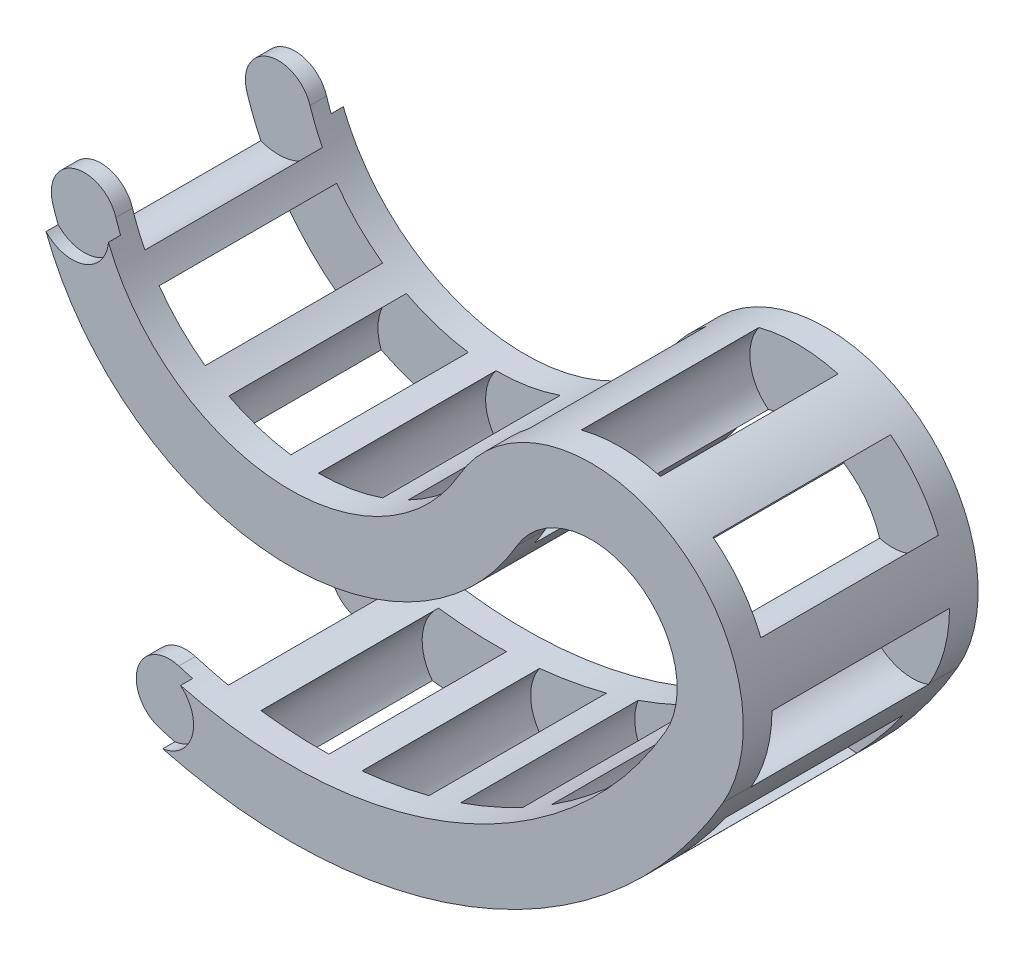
ISO-10303-21;
HEADER;
FILE_DESCRIPTION(('STEP AP214'),'2;1');
FILE_NAME('part.step','',(''),(''),'','','');
FILE_SCHEMA(('AUTOMOTIVE_DESIGN { 1 0 10303 214 1 1 1 1 }'));
ENDSEC;
DATA;
#1=APPLICATION_CONTEXT('core data for automotive mechanical design processes');
#2=APPLICATION_PROTOCOL_DEFINITION('international standard','automotive_design',2000,#1);
#3=PRODUCT_CONTEXT('',#1,'mechanical');
#4=PRODUCT('Part','Part','',(#3));
#5=PRODUCT_RELATED_PRODUCT_CATEGORY('part','',(#4));
#6=PRODUCT_DEFINITION_FORMATION('','',#4);
#7=PRODUCT_DEFINITION_CONTEXT('part definition',#1,'design');
#8=PRODUCT_DEFINITION('design','',#6,#7);
#9=PRODUCT_DEFINITION_SHAPE('','',#8);
#10=(LENGTH_UNIT() NAMED_UNIT(*) SI_UNIT(.MILLI.,.METRE.));
#11=(NAMED_UNIT(*) PLANE_ANGLE_UNIT() SI_UNIT($,.RADIAN.));
#12=(NAMED_UNIT(*) SI_UNIT($,.STERADIAN.) SOLID_ANGLE_UNIT());
#13=UNCERTAINTY_MEASURE_WITH_UNIT(LENGTH_MEASURE(1.E-05),#10,'distance_accuracy_value','');
#14=(GEOMETRIC_REPRESENTATION_CONTEXT(3) GLOBAL_UNCERTAINTY_ASSIGNED_CONTEXT((#13)) GLOBAL_UNIT_ASSIGNED_CONTEXT((#10,
#11,#12)) REPRESENTATION_CONTEXT('',''));
#15=CARTESIAN_POINT('',(0.,0.,0.));
#16=DIRECTION('',(0.,0.,1.));
#17=DIRECTION('',(1.,0.,0.));
#18=AXIS2_PLACEMENT_3D('',#15,#16,#17);
#19=CARTESIAN_POINT('',(0.,0.,145.5));
#20=DIRECTION('',(0.,0.,-1.));
#21=DIRECTION('',(-1.,0.,0.));
#22=AXIS2_PLACEMENT_3D('',#19,#20,#21);
#23=CYLINDRICAL_SURFACE('',#22,537.281073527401);
#24=DIRECTION('',(0.,0.,1.));
#25=VECTOR('',#24,1.);
#26=CARTESIAN_POINT('',(-71.6960543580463,-532.475941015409,0.));
#27=LINE('',#26,#25);
#28=CARTESIAN_POINT('',(-71.6960543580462,-532.475941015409,-110.));
#29=VERTEX_POINT('',#28);
#30=CARTESIAN_POINT('',(-71.6960543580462,-532.475941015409,110.));
#31=VERTEX_POINT('',#30);
#32=EDGE_CURVE('E597',#29,#31,#27,.T.);
#33=ORIENTED_EDGE('',*,*,#32,.F.);
#34=CARTESIAN_POINT('',(0.,0.,-110.));
#35=DIRECTION('',(0.,0.,1.));
#36=DIRECTION('',(1.,0.,0.));
#37=AXIS2_PLACEMENT_3D('',#34,#35,#36);
#38=CIRCLE('',#37,537.281073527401);
#39=CARTESIAN_POINT('',(12.5598731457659,-537.134249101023,-110.));
#40=VERTEX_POINT('',#39);
#41=EDGE_CURVE('E592',#29,#40,#38,.T.);
#42=ORIENTED_EDGE('',*,*,#41,.T.);
#43=DIRECTION('',(0.,0.,1.));
#44=VECTOR('',#43,1.);
#45=CARTESIAN_POINT('',(12.5598731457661,-537.134249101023,0.));
#46=LINE('',#45,#44);
#47=CARTESIAN_POINT('',(12.5598731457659,-537.134249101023,110.));
#48=VERTEX_POINT('',#47);
#49=EDGE_CURVE('E595',#48,#40,#46,.F.);
#50=ORIENTED_EDGE('',*,*,#49,.F.);
#51=CARTESIAN_POINT('',(0.,0.,110.));
#52=DIRECTION('',(0.,0.,1.));
#53=DIRECTION('',(1.,0.,0.));
#54=AXIS2_PLACEMENT_3D('',#51,#52,#53);
#55=CIRCLE('',#54,537.281073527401);
#56=EDGE_CURVE('E590',#31,#48,#55,.T.);
#57=ORIENTED_EDGE('',*,*,#56,.F.);
#58=EDGE_LOOP('',(#33,#42,#50,#57));
#59=FACE_BOUND('',#58,.T.);
#60=DIRECTION('',(0.,0.,1.));
#61=VECTOR('',#60,1.);
#62=CARTESIAN_POINT('',(175.787022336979,-507.710424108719,0.));
#63=LINE('',#62,#61);
#64=CARTESIAN_POINT('',(175.787022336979,-507.710424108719,-110.));
#65=VERTEX_POINT('',#64);
#66=CARTESIAN_POINT('',(175.787022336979,-507.710424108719,110.));
#67=VERTEX_POINT('',#66);
#68=EDGE_CURVE('E632',#65,#67,#63,.T.);
#69=ORIENTED_EDGE('',*,*,#68,.F.);
#70=CARTESIAN_POINT('',(0.,0.,-110.));
#71=DIRECTION('',(0.,0.,1.));
#72=DIRECTION('',(1.,0.,0.));
#73=AXIS2_PLACEMENT_3D('',#70,#71,#72);
#74=CIRCLE('',#73,537.281073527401);
#75=CARTESIAN_POINT('',(253.112943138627,-473.924877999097,-110.));
#76=VERTEX_POINT('',#75);
#77=EDGE_CURVE('E627',#65,#76,#74,.T.);
#78=ORIENTED_EDGE('',*,*,#77,.T.);
#79=DIRECTION('',(0.,0.,1.));
#80=VECTOR('',#79,1.);
#81=CARTESIAN_POINT('',(253.112943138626,-473.924877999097,0.));
#82=LINE('',#81,#80);
#83=CARTESIAN_POINT('',(253.112943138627,-473.924877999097,110.));
#84=VERTEX_POINT('',#83);
#85=EDGE_CURVE('E630',#84,#76,#82,.F.);
#86=ORIENTED_EDGE('',*,*,#85,.F.);
#87=CARTESIAN_POINT('',(0.,0.,110.));
#88=DIRECTION('',(0.,0.,1.));
#89=DIRECTION('',(1.,0.,0.));
#90=AXIS2_PLACEMENT_3D('',#87,#88,#89);
#91=CIRCLE('',#90,537.281073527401);
#92=EDGE_CURVE('E625',#67,#84,#91,.T.);
#93=ORIENTED_EDGE('',*,*,#92,.F.);
#94=EDGE_LOOP('',(#69,#78,#86,#93));
#95=FACE_BOUND('',#94,.T.);
#96=DIRECTION('',(0.,0.,1.));
#97=VECTOR('',#96,1.);
#98=CARTESIAN_POINT('',(385.599537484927,-374.144288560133,0.));
#99=LINE('',#98,#97);
#100=CARTESIAN_POINT('',(385.599537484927,-374.144288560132,-110.));
#101=VERTEX_POINT('',#100);
#102=CARTESIAN_POINT('',(385.599537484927,-374.144288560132,110.));
#103=VERTEX_POINT('',#102);
#104=EDGE_CURVE('E668',#101,#103,#99,.T.);
#105=ORIENTED_EDGE('',*,*,#104,.F.);
#106=CARTESIAN_POINT('',(0.,0.,-110.));
#107=DIRECTION('',(0.,0.,1.));
#108=DIRECTION('',(1.,0.,0.));
#109=AXIS2_PLACEMENT_3D('',#106,#107,#108);
#110=CIRCLE('',#109,537.281073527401);
#111=CARTESIAN_POINT('',(439.424769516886,-309.155015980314,-110.));
#112=VERTEX_POINT('',#111);
#113=EDGE_CURVE('E663',#101,#112,#110,.T.);
#114=ORIENTED_EDGE('',*,*,#113,.T.);
#115=DIRECTION('',(0.,0.,1.));
#116=VECTOR('',#115,1.);
#117=CARTESIAN_POINT('',(439.424769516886,-309.155015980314,0.));
#118=LINE('',#117,#116);
#119=CARTESIAN_POINT('',(439.424769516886,-309.155015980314,110.));
#120=VERTEX_POINT('',#119);
#121=EDGE_CURVE('E666',#120,#112,#118,.F.);
#122=ORIENTED_EDGE('',*,*,#121,.F.);
#123=CARTESIAN_POINT('',(0.,0.,110.));
#124=DIRECTION('',(0.,0.,1.));
#125=DIRECTION('',(1.,0.,0.));
#126=AXIS2_PLACEMENT_3D('',#123,#124,#125);
#127=CIRCLE('',#126,537.281073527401);
#128=EDGE_CURVE('E661',#103,#120,#127,.T.);
#129=ORIENTED_EDGE('',*,*,#128,.F.);
#130=EDGE_LOOP('',(#105,#114,#122,#129));
#131=FACE_BOUND('',#130,.T.);
#132=DIRECTION('',(0.,0.,1.));
#133=VECTOR('',#132,1.);
#134=CARTESIAN_POINT('',(288.528500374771,-453.235321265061,0.));
#135=LINE('',#134,#133);
#136=CARTESIAN_POINT('',(288.528500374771,-453.23532126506,-110.));
#137=VERTEX_POINT('',#136);
#138=CARTESIAN_POINT('',(288.528500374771,-453.23532126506,110.));
#139=VERTEX_POINT('',#138);
#140=EDGE_CURVE('E650',#137,#139,#135,.T.);
#141=ORIENTED_EDGE('',*,*,#140,.F.);
#142=CARTESIAN_POINT('',(0.,0.,-110.));
#143=DIRECTION('',(0.,0.,1.));
#144=DIRECTION('',(1.,0.,0.));
#145=AXIS2_PLACEMENT_3D('',#142,#143,#144);
#146=CIRCLE('',#145,537.281073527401);
#147=CARTESIAN_POINT('',(355.934541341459,-402.469320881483,-110.));
#148=VERTEX_POINT('',#147);
#149=EDGE_CURVE('E645',#137,#148,#146,.T.);
#150=ORIENTED_EDGE('',*,*,#149,.T.);
#151=DIRECTION('',(0.,0.,1.));
#152=VECTOR('',#151,1.);
#153=CARTESIAN_POINT('',(355.934541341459,-402.469320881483,0.));
#154=LINE('',#153,#152);
#155=CARTESIAN_POINT('',(355.934541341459,-402.469320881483,110.));
#156=VERTEX_POINT('',#155);
#157=EDGE_CURVE('E648',#156,#148,#154,.F.);
#158=ORIENTED_EDGE('',*,*,#157,.F.);
#159=CARTESIAN_POINT('',(0.,0.,110.));
#160=DIRECTION('',(0.,0.,1.));
#161=DIRECTION('',(1.,0.,0.));
#162=AXIS2_PLACEMENT_3D('',#159,#160,#161);
#163=CIRCLE('',#162,537.281073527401);
#164=EDGE_CURVE('E643',#139,#156,#163,.T.);
#165=ORIENTED_EDGE('',*,*,#164,.F.);
#166=EDGE_LOOP('',(#141,#150,#158,#165));
#167=FACE_BOUND('',#166,.T.);
#168=DIRECTION('',(0.,0.,1.));
#169=VECTOR('',#168,1.);
#170=CARTESIAN_POINT('',(53.4982720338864,-534.610967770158,0.));
#171=LINE('',#170,#169);
#172=CARTESIAN_POINT('',(53.4982720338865,-534.610967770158,-110.));
#173=VERTEX_POINT('',#172);
#174=CARTESIAN_POINT('',(53.4982720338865,-534.610967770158,110.));
#175=VERTEX_POINT('',#174);
#176=EDGE_CURVE('E614',#173,#175,#171,.T.);
#177=ORIENTED_EDGE('',*,*,#176,.F.);
#178=CARTESIAN_POINT('',(0.,0.,-110.));
#179=DIRECTION('',(0.,0.,1.));
#180=DIRECTION('',(1.,0.,0.));
#181=AXIS2_PLACEMENT_3D('',#178,#179,#180);
#182=CIRCLE('',#181,537.281073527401);
#183=CARTESIAN_POINT('',(136.544379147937,-519.640822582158,-110.));
#184=VERTEX_POINT('',#183);
#185=EDGE_CURVE('E609',#173,#184,#182,.T.);
#186=ORIENTED_EDGE('',*,*,#185,.T.);
#187=DIRECTION('',(0.,0.,1.));
#188=VECTOR('',#187,1.);
#189=CARTESIAN_POINT('',(136.544379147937,-519.640822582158,0.));
#190=LINE('',#189,#188);
#191=CARTESIAN_POINT('',(136.544379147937,-519.640822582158,110.));
#192=VERTEX_POINT('',#191);
#193=EDGE_CURVE('E612',#192,#184,#190,.F.);
#194=ORIENTED_EDGE('',*,*,#193,.F.);
#195=CARTESIAN_POINT('',(0.,0.,110.));
#196=DIRECTION('',(0.,0.,1.));
#197=DIRECTION('',(1.,0.,0.));
#198=AXIS2_PLACEMENT_3D('',#195,#196,#197);
#199=CIRCLE('',#198,537.281073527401);
#200=EDGE_CURVE('E607',#175,#192,#199,.T.);
#201=ORIENTED_EDGE('',*,*,#200,.F.);
#202=EDGE_LOOP('',(#177,#186,#194,#201));
#203=FACE_BOUND('',#202,.T.);
#204=DIRECTION('',(0.,0.,-1.));
#205=VECTOR('',#204,1.);
#206=CARTESIAN_POINT('',(-153.024185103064,-515.02868924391,145.5));
#207=LINE('',#206,#205);
#208=CARTESIAN_POINT('',(-153.024185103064,-515.02868924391,-110.));
#209=VERTEX_POINT('',#208);
#210=CARTESIAN_POINT('',(-153.024185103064,-515.02868924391,-130.5));
#211=VERTEX_POINT('',#210);
#212=EDGE_CURVE('E966',#209,#211,#207,.T.);
#213=ORIENTED_EDGE('',*,*,#212,.F.);
#214=CARTESIAN_POINT('',(0.,0.,-110.));
#215=DIRECTION('',(0.,0.,1.));
#216=DIRECTION('',(1.,0.,0.));
#217=AXIS2_PLACEMENT_3D('',#214,#215,#216);
#218=CIRCLE('',#217,537.281073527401);
#219=CARTESIAN_POINT('',(-112.106779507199,-525.455061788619,-110.));
#220=VERTEX_POINT('',#219);
#221=EDGE_CURVE('E578',#209,#220,#218,.T.);
#222=ORIENTED_EDGE('',*,*,#221,.T.);
#223=DIRECTION('',(0.,0.,1.));
#224=VECTOR('',#223,1.);
#225=CARTESIAN_POINT('',(-112.106779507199,-525.455061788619,0.));
#226=LINE('',#225,#224);
#227=CARTESIAN_POINT('',(-112.106779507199,-525.455061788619,110.));
#228=VERTEX_POINT('',#227);
#229=EDGE_CURVE('E572',#228,#220,#226,.F.);
#230=ORIENTED_EDGE('',*,*,#229,.F.);
#231=CARTESIAN_POINT('',(0.,0.,110.));
#232=DIRECTION('',(0.,0.,1.));
#233=DIRECTION('',(1.,0.,0.));
#234=AXIS2_PLACEMENT_3D('',#231,#232,#233);
#235=CIRCLE('',#234,537.281073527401);
#236=CARTESIAN_POINT('',(-153.024185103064,-515.02868924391,110.));
#237=VERTEX_POINT('',#236);
#238=EDGE_CURVE('E558',#237,#228,#235,.T.);
#239=ORIENTED_EDGE('',*,*,#238,.F.);
#240=CARTESIAN_POINT('',(-153.024185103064,-515.02868924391,130.5));
#241=VERTEX_POINT('',#240);
#242=EDGE_CURVE('E967',#241,#237,#207,.T.);
#243=ORIENTED_EDGE('',*,*,#242,.F.);
#244=CARTESIAN_POINT('',(0.,0.,130.5));
#245=DIRECTION('',(0.,0.,1.));
#246=DIRECTION('',(1.,0.,0.));
#247=AXIS2_PLACEMENT_3D('',#244,#245,#246);
#248=CIRCLE('',#247,537.281073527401);
#249=CARTESIAN_POINT('',(-135.8046239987,-519.834643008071,130.5));
#250=VERTEX_POINT('',#249);
#251=EDGE_CURVE('E913',#241,#250,#248,.T.);
#252=ORIENTED_EDGE('',*,*,#251,.T.);
#253=DIRECTION('',(0.,0.,1.));
#254=VECTOR('',#253,1.);
#255=CARTESIAN_POINT('',(-135.8046239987,-519.83464300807,138.));
#256=LINE('',#255,#254);
#257=CARTESIAN_POINT('',(-135.804623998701,-519.83464300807,145.5));
#258=VERTEX_POINT('',#257);
#259=EDGE_CURVE('E919',#258,#250,#256,.F.);
#260=ORIENTED_EDGE('',*,*,#259,.F.);
#261=CARTESIAN_POINT('',(0.,0.,145.5));
#262=DIRECTION('',(0.,0.,1.));
#263=DIRECTION('',(1.,0.,0.));
#264=AXIS2_PLACEMENT_3D('',#261,#262,#263);
#265=CIRCLE('',#264,537.281073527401);
#266=CARTESIAN_POINT('',(465.299058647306,-268.640536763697,145.5));
#267=VERTEX_POINT('',#266);
#268=EDGE_CURVE('E948',#258,#267,#265,.T.);
#269=ORIENTED_EDGE('',*,*,#268,.T.);
#270=DIRECTION('',(0.,0.,-1.));
#271=VECTOR('',#270,1.);
#272=CARTESIAN_POINT('',(465.299058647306,-268.640536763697,145.5));
#273=LINE('',#272,#271);
#274=CARTESIAN_POINT('',(465.299058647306,-268.640536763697,110.));
#275=VERTEX_POINT('',#274);
#276=EDGE_CURVE('E970',#267,#275,#273,.T.);
#277=ORIENTED_EDGE('',*,*,#276,.T.);
#278=CARTESIAN_POINT('',(0.,0.,110.));
#279=DIRECTION('',(0.,0.,1.));
#280=DIRECTION('',(1.,0.,0.));
#281=AXIS2_PLACEMENT_3D('',#278,#279,#280);
#282=CIRCLE('',#281,537.281073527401);
#283=CARTESIAN_POINT('',(460.037287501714,-277.554762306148,110.));
#284=VERTEX_POINT('',#283);
#285=EDGE_CURVE('E682',#284,#275,#282,.T.);
#286=ORIENTED_EDGE('',*,*,#285,.F.);
#287=DIRECTION('',(0.,0.,1.));
#288=VECTOR('',#287,1.);
#289=CARTESIAN_POINT('',(460.037287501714,-277.554762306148,0.));
#290=LINE('',#289,#288);
#291=CARTESIAN_POINT('',(460.037287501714,-277.554762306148,-110.));
#292=VERTEX_POINT('',#291);
#293=EDGE_CURVE('E694',#292,#284,#290,.T.);
#294=ORIENTED_EDGE('',*,*,#293,.F.);
#295=CARTESIAN_POINT('',(0.,0.,-110.));
#296=DIRECTION('',(0.,0.,1.));
#297=DIRECTION('',(1.,0.,0.));
#298=AXIS2_PLACEMENT_3D('',#295,#296,#297);
#299=CIRCLE('',#298,537.281073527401);
#300=CARTESIAN_POINT('',(465.299058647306,-268.640536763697,-110.));
#301=VERTEX_POINT('',#300);
#302=EDGE_CURVE('E688',#292,#301,#299,.T.);
#303=ORIENTED_EDGE('',*,*,#302,.T.);
#304=CARTESIAN_POINT('',(465.299058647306,-268.640536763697,-145.5));
#305=VERTEX_POINT('',#304);
#306=EDGE_CURVE('E969',#301,#305,#273,.T.);
#307=ORIENTED_EDGE('',*,*,#306,.T.);
#308=CARTESIAN_POINT('',(0.,0.,-145.5));
#309=DIRECTION('',(0.,0.,1.));
#310=DIRECTION('',(1.,0.,0.));
#311=AXIS2_PLACEMENT_3D('',#308,#309,#310);
#312=CIRCLE('',#311,537.281073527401);
#313=CARTESIAN_POINT('',(-135.804623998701,-519.834643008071,-145.5));
#314=VERTEX_POINT('',#313);
#315=EDGE_CURVE('E930',#314,#305,#312,.T.);
#316=ORIENTED_EDGE('',*,*,#315,.F.);
#317=DIRECTION('',(0.,0.,-1.));
#318=VECTOR('',#317,1.);
#319=CARTESIAN_POINT('',(-135.8046239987,-519.83464300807,-138.));
#320=LINE('',#319,#318);
#321=CARTESIAN_POINT('',(-135.8046239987,-519.834643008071,-130.5));
#322=VERTEX_POINT('',#321);
#323=EDGE_CURVE('E882',#314,#322,#320,.F.);
#324=ORIENTED_EDGE('',*,*,#323,.T.);
#325=CARTESIAN_POINT('',(0.,0.,-130.5));
#326=DIRECTION('',(0.,0.,-1.));
#327=DIRECTION('',(-1.,0.,0.));
#328=AXIS2_PLACEMENT_3D('',#325,#326,#327);
#329=CIRCLE('',#328,537.281073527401);
#330=EDGE_CURVE('E888',#322,#211,#329,.T.);
#331=ORIENTED_EDGE('',*,*,#330,.T.);
#332=EDGE_LOOP('',(#213,#222,#230,#239,#243,#252,#260,#269,#277,#286,#294,#303,#307,#316,#324,#331));
#333=FACE_BOUND('',#332,.T.);
#334=ADVANCED_FACE('F62',(#59,#95,#131,#167,#203,#333),#23,.F.);
#335=CARTESIAN_POINT('',(0.,0.,145.5));
#336=DIRECTION('',(0.,0.,-1.));
#337=DIRECTION('',(-1.,0.,0.));
#338=AXIS2_PLACEMENT_3D('',#335,#336,#337);
#339=CYLINDRICAL_SURFACE('',#338,619.281073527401);
#340=CARTESIAN_POINT('',(0.,0.,-110.));
#341=DIRECTION('',(0.,0.,1.));
#342=DIRECTION('',(1.,0.,0.));
#343=AXIS2_PLACEMENT_3D('',#340,#341,#342);
#344=CIRCLE('',#343,619.281073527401);
#345=CARTESIAN_POINT('',(-79.3280387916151,-614.17921675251,-110.));
#346=VERTEX_POINT('',#345);
#347=CARTESIAN_POINT('',(11.1385172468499,-619.18089558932,-110.));
#348=VERTEX_POINT('',#347);
#349=EDGE_CURVE('E1141',#346,#348,#344,.T.);
#350=ORIENTED_EDGE('',*,*,#349,.F.);
#351=DIRECTION('',(0.,0.,1.));
#352=VECTOR('',#351,1.);
#353=CARTESIAN_POINT('',(-79.3280387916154,-614.17921675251,0.));
#354=LINE('',#353,#352);
#355=CARTESIAN_POINT('',(-79.3280387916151,-614.17921675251,110.));
#356=VERTEX_POINT('',#355);
#357=EDGE_CURVE('E1138',#346,#356,#354,.T.);
#358=ORIENTED_EDGE('',*,*,#357,.T.);
#359=CARTESIAN_POINT('',(0.,0.,110.));
#360=DIRECTION('',(0.,0.,1.));
#361=DIRECTION('',(1.,0.,0.));
#362=AXIS2_PLACEMENT_3D('',#359,#360,#361);
#363=CIRCLE('',#362,619.281073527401);
#364=CARTESIAN_POINT('',(11.1385172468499,-619.18089558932,110.));
#365=VERTEX_POINT('',#364);
#366=EDGE_CURVE('E1132',#356,#365,#363,.T.);
#367=ORIENTED_EDGE('',*,*,#366,.T.);
#368=DIRECTION('',(0.,0.,1.));
#369=VECTOR('',#368,1.);
#370=CARTESIAN_POINT('',(11.1385172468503,-619.18089558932,0.));
#371=LINE('',#370,#369);
#372=EDGE_CURVE('E1135',#365,#348,#371,.F.);
#373=ORIENTED_EDGE('',*,*,#372,.T.);
#374=EDGE_LOOP('',(#350,#358,#367,#373));
#375=FACE_BOUND('',#374,.T.);
#376=CARTESIAN_POINT('',(0.,0.,-110.));
#377=DIRECTION('',(0.,0.,1.));
#378=DIRECTION('',(1.,0.,0.));
#379=AXIS2_PLACEMENT_3D('',#376,#377,#378);
#380=CIRCLE('',#379,619.281073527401);
#381=CARTESIAN_POINT('',(205.767927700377,-584.096402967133,-110.));
#382=VERTEX_POINT('',#381);
#383=CARTESIAN_POINT('',(288.793656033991,-547.820474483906,-110.));
#384=VERTEX_POINT('',#383);
#385=EDGE_CURVE('E1119',#382,#384,#380,.T.);
#386=ORIENTED_EDGE('',*,*,#385,.F.);
#387=DIRECTION('',(0.,0.,1.));
#388=VECTOR('',#387,1.);
#389=CARTESIAN_POINT('',(205.767927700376,-584.096402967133,0.));
#390=LINE('',#389,#388);
#391=CARTESIAN_POINT('',(205.767927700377,-584.096402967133,110.));
#392=VERTEX_POINT('',#391);
#393=EDGE_CURVE('E1116',#382,#392,#390,.T.);
#394=ORIENTED_EDGE('',*,*,#393,.T.);
#395=CARTESIAN_POINT('',(0.,0.,110.));
#396=DIRECTION('',(0.,0.,1.));
#397=DIRECTION('',(1.,0.,0.));
#398=AXIS2_PLACEMENT_3D('',#395,#396,#397);
#399=CIRCLE('',#398,619.281073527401);
#400=CARTESIAN_POINT('',(288.793656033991,-547.820474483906,110.));
#401=VERTEX_POINT('',#400);
#402=EDGE_CURVE('E1110',#392,#401,#399,.T.);
#403=ORIENTED_EDGE('',*,*,#402,.T.);
#404=DIRECTION('',(0.,0.,1.));
#405=VECTOR('',#404,1.);
#406=CARTESIAN_POINT('',(288.793656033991,-547.820474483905,0.));
#407=LINE('',#406,#405);
#408=EDGE_CURVE('E1113',#401,#384,#407,.F.);
#409=ORIENTED_EDGE('',*,*,#408,.T.);
#410=EDGE_LOOP('',(#386,#394,#403,#409));
#411=FACE_BOUND('',#410,.T.);
#412=CARTESIAN_POINT('',(0.,0.,-110.));
#413=DIRECTION('',(0.,0.,1.));
#414=DIRECTION('',(1.,0.,0.));
#415=AXIS2_PLACEMENT_3D('',#412,#413,#414);
#416=CIRCLE('',#415,619.281073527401);
#417=CARTESIAN_POINT('',(446.768526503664,-428.843714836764,-110.));
#418=VERTEX_POINT('',#417);
#419=CARTESIAN_POINT('',(504.561295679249,-359.063987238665,-110.));
#420=VERTEX_POINT('',#419);
#421=EDGE_CURVE('E1097',#418,#420,#416,.T.);
#422=ORIENTED_EDGE('',*,*,#421,.F.);
#423=DIRECTION('',(0.,0.,1.));
#424=VECTOR('',#423,1.);
#425=CARTESIAN_POINT('',(446.768526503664,-428.843714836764,0.));
#426=LINE('',#425,#424);
#427=CARTESIAN_POINT('',(446.768526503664,-428.843714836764,110.));
#428=VERTEX_POINT('',#427);
#429=EDGE_CURVE('E1094',#418,#428,#426,.T.);
#430=ORIENTED_EDGE('',*,*,#429,.T.);
#431=CARTESIAN_POINT('',(0.,0.,110.));
#432=DIRECTION('',(0.,0.,1.));
#433=DIRECTION('',(1.,0.,0.));
#434=AXIS2_PLACEMENT_3D('',#431,#432,#433);
#435=CIRCLE('',#434,619.281073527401);
#436=CARTESIAN_POINT('',(504.561295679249,-359.063987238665,110.));
#437=VERTEX_POINT('',#436);
#438=EDGE_CURVE('E1088',#428,#437,#435,.T.);
#439=ORIENTED_EDGE('',*,*,#438,.T.);
#440=DIRECTION('',(0.,0.,1.));
#441=VECTOR('',#440,1.);
#442=CARTESIAN_POINT('',(504.561295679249,-359.063987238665,0.));
#443=LINE('',#442,#441);
#444=EDGE_CURVE('E1091',#437,#420,#443,.F.);
#445=ORIENTED_EDGE('',*,*,#444,.T.);
#446=EDGE_LOOP('',(#422,#430,#439,#445));
#447=FACE_BOUND('',#446,.T.);
#448=CARTESIAN_POINT('',(0.,0.,-110.));
#449=DIRECTION('',(0.,0.,1.));
#450=DIRECTION('',(1.,0.,0.));
#451=AXIS2_PLACEMENT_3D('',#448,#449,#450);
#452=CIRCLE('',#451,619.281073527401);
#453=CARTESIAN_POINT('',(335.375618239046,-520.607570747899,-110.));
#454=VERTEX_POINT('',#453);
#455=CARTESIAN_POINT('',(407.750257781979,-466.099533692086,-110.));
#456=VERTEX_POINT('',#455);
#457=EDGE_CURVE('E1108',#454,#456,#452,.T.);
#458=ORIENTED_EDGE('',*,*,#457,.F.);
#459=DIRECTION('',(0.,0.,1.));
#460=VECTOR('',#459,1.);
#461=CARTESIAN_POINT('',(335.375618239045,-520.607570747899,0.));
#462=LINE('',#461,#460);
#463=CARTESIAN_POINT('',(335.375618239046,-520.607570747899,110.));
#464=VERTEX_POINT('',#463);
#465=EDGE_CURVE('E1105',#454,#464,#462,.T.);
#466=ORIENTED_EDGE('',*,*,#465,.T.);
#467=CARTESIAN_POINT('',(0.,0.,110.));
#468=DIRECTION('',(0.,0.,1.));
#469=DIRECTION('',(1.,0.,0.));
#470=AXIS2_PLACEMENT_3D('',#467,#468,#469);
#471=CIRCLE('',#470,619.281073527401);
#472=CARTESIAN_POINT('',(407.750257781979,-466.099533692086,110.));
#473=VERTEX_POINT('',#472);
#474=EDGE_CURVE('E1099',#464,#473,#471,.T.);
#475=ORIENTED_EDGE('',*,*,#474,.T.);
#476=DIRECTION('',(0.,0.,1.));
#477=VECTOR('',#476,1.);
#478=CARTESIAN_POINT('',(407.750257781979,-466.099533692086,0.));
#479=LINE('',#478,#477);
#480=EDGE_CURVE('E1102',#473,#456,#479,.F.);
#481=ORIENTED_EDGE('',*,*,#480,.T.);
#482=EDGE_LOOP('',(#458,#466,#475,#481));
#483=FACE_BOUND('',#482,.T.);
#484=CARTESIAN_POINT('',(0.,0.,-110.));
#485=DIRECTION('',(0.,0.,1.));
#486=DIRECTION('',(1.,0.,0.));
#487=AXIS2_PLACEMENT_3D('',#484,#485,#486);
#488=CIRCLE('',#487,619.281073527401);
#489=CARTESIAN_POINT('',(64.9846543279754,-615.862032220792,-110.));
#490=VERTEX_POINT('',#489);
#491=CARTESIAN_POINT('',(154.152212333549,-599.788415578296,-110.));
#492=VERTEX_POINT('',#491);
#493=EDGE_CURVE('E1130',#490,#492,#488,.T.);
#494=ORIENTED_EDGE('',*,*,#493,.F.);
#495=DIRECTION('',(0.,0.,1.));
#496=VECTOR('',#495,1.);
#497=CARTESIAN_POINT('',(64.984654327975,-615.862032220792,0.));
#498=LINE('',#497,#496);
#499=CARTESIAN_POINT('',(64.9846543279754,-615.862032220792,110.));
#500=VERTEX_POINT('',#499);
#501=EDGE_CURVE('E1127',#490,#500,#498,.T.);
#502=ORIENTED_EDGE('',*,*,#501,.T.);
#503=CARTESIAN_POINT('',(0.,0.,110.));
#504=DIRECTION('',(0.,0.,1.));
#505=DIRECTION('',(1.,0.,0.));
#506=AXIS2_PLACEMENT_3D('',#503,#504,#505);
#507=CIRCLE('',#506,619.281073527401);
#508=CARTESIAN_POINT('',(154.152212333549,-599.788415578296,110.));
#509=VERTEX_POINT('',#508);
#510=EDGE_CURVE('E1121',#500,#509,#507,.T.);
#511=ORIENTED_EDGE('',*,*,#510,.T.);
#512=DIRECTION('',(0.,0.,1.));
#513=VECTOR('',#512,1.);
#514=CARTESIAN_POINT('',(154.15221233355,-599.788415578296,0.));
#515=LINE('',#514,#513);
#516=EDGE_CURVE('E1124',#509,#492,#515,.F.);
#517=ORIENTED_EDGE('',*,*,#516,.T.);
#518=EDGE_LOOP('',(#494,#502,#511,#517));
#519=FACE_BOUND('',#518,.T.);
#520=CARTESIAN_POINT('',(0.,0.,-110.));
#521=DIRECTION('',(0.,0.,1.));
#522=DIRECTION('',(1.,0.,0.));
#523=AXIS2_PLACEMENT_3D('',#520,#521,#522);
#524=CIRCLE('',#523,619.281073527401);
#525=CARTESIAN_POINT('',(-176.37878253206,-593.632523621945,-110.));
#526=VERTEX_POINT('',#525);
#527=CARTESIAN_POINT('',(-132.480128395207,-604.944678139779,-110.));
#528=VERTEX_POINT('',#527);
#529=EDGE_CURVE('E567',#526,#528,#524,.T.);
#530=ORIENTED_EDGE('',*,*,#529,.F.);
#531=DIRECTION('',(0.,0.,-1.));
#532=VECTOR('',#531,1.);
#533=CARTESIAN_POINT('',(-176.37878253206,-593.632523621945,145.5));
#534=LINE('',#533,#532);
#535=CARTESIAN_POINT('',(-176.37878253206,-593.632523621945,-130.5));
#536=VERTEX_POINT('',#535);
#537=EDGE_CURVE('E962',#526,#536,#534,.T.);
#538=ORIENTED_EDGE('',*,*,#537,.T.);
#539=CARTESIAN_POINT('',(0.,0.,-130.5));
#540=DIRECTION('',(0.,0.,-1.));
#541=DIRECTION('',(-1.,0.,0.));
#542=AXIS2_PLACEMENT_3D('',#539,#540,#541);
#543=CIRCLE('',#542,619.281073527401);
#544=CARTESIAN_POINT('',(-157.897732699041,-598.813288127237,-130.5));
#545=VERTEX_POINT('',#544);
#546=EDGE_CURVE('E993',#545,#536,#543,.T.);
#547=ORIENTED_EDGE('',*,*,#546,.F.);
#548=DIRECTION('',(0.,0.,-1.));
#549=VECTOR('',#548,1.);
#550=CARTESIAN_POINT('',(-157.897732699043,-598.813288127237,-138.));
#551=LINE('',#550,#549);
#552=CARTESIAN_POINT('',(-157.897732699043,-598.813288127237,-145.5));
#553=VERTEX_POINT('',#552);
#554=EDGE_CURVE('E880',#553,#545,#551,.F.);
#555=ORIENTED_EDGE('',*,*,#554,.F.);
#556=CARTESIAN_POINT('',(0.,0.,-145.5));
#557=DIRECTION('',(0.,0.,1.));
#558=DIRECTION('',(1.,0.,0.));
#559=AXIS2_PLACEMENT_3D('',#556,#557,#558);
#560=CIRCLE('',#559,619.281073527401);
#561=CARTESIAN_POINT('',(536.313141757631,-309.640536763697,-145.5));
#562=VERTEX_POINT('',#561);
#563=EDGE_CURVE('E933',#553,#562,#560,.T.);
#564=ORIENTED_EDGE('',*,*,#563,.T.);
#565=DIRECTION('',(0.,0.,-1.));
#566=VECTOR('',#565,1.);
#567=CARTESIAN_POINT('',(536.313141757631,-309.640536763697,145.5));
#568=LINE('',#567,#566);
#569=CARTESIAN_POINT('',(536.313141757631,-309.640536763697,-110.));
#570=VERTEX_POINT('',#569);
#571=EDGE_CURVE('E958',#570,#562,#568,.T.);
#572=ORIENTED_EDGE('',*,*,#571,.F.);
#573=CARTESIAN_POINT('',(0.,0.,-110.));
#574=DIRECTION('',(0.,0.,1.));
#575=DIRECTION('',(1.,0.,0.));
#576=AXIS2_PLACEMENT_3D('',#573,#574,#575);
#577=CIRCLE('',#576,619.281073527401);
#578=CARTESIAN_POINT('',(535.669979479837,-310.75186421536,-110.));
#579=VERTEX_POINT('',#578);
#580=EDGE_CURVE('E1086',#579,#570,#577,.T.);
#581=ORIENTED_EDGE('',*,*,#580,.F.);
#582=DIRECTION('',(0.,0.,1.));
#583=VECTOR('',#582,1.);
#584=CARTESIAN_POINT('',(535.669979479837,-310.75186421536,0.));
#585=LINE('',#584,#583);
#586=CARTESIAN_POINT('',(535.669979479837,-310.75186421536,110.));
#587=VERTEX_POINT('',#586);
#588=EDGE_CURVE('E1083',#579,#587,#585,.T.);
#589=ORIENTED_EDGE('',*,*,#588,.T.);
#590=CARTESIAN_POINT('',(0.,0.,110.));
#591=DIRECTION('',(0.,0.,1.));
#592=DIRECTION('',(1.,0.,0.));
#593=AXIS2_PLACEMENT_3D('',#590,#591,#592);
#594=CIRCLE('',#593,619.281073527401);
#595=CARTESIAN_POINT('',(536.313141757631,-309.640536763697,110.));
#596=VERTEX_POINT('',#595);
#597=EDGE_CURVE('E1080',#587,#596,#594,.T.);
#598=ORIENTED_EDGE('',*,*,#597,.T.);
#599=CARTESIAN_POINT('',(536.313141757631,-309.640536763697,145.5));
#600=VERTEX_POINT('',#599);
#601=EDGE_CURVE('E959',#600,#596,#568,.T.);
#602=ORIENTED_EDGE('',*,*,#601,.F.);
#603=CARTESIAN_POINT('',(0.,0.,145.5));
#604=DIRECTION('',(0.,0.,1.));
#605=DIRECTION('',(1.,0.,0.));
#606=AXIS2_PLACEMENT_3D('',#603,#604,#605);
#607=CIRCLE('',#606,619.281073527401);
#608=CARTESIAN_POINT('',(-157.897732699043,-598.813288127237,145.5));
#609=VERTEX_POINT('',#608);
#610=EDGE_CURVE('E950',#609,#600,#607,.T.);
#611=ORIENTED_EDGE('',*,*,#610,.F.);
#612=DIRECTION('',(0.,0.,1.));
#613=VECTOR('',#612,1.);
#614=CARTESIAN_POINT('',(-157.897732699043,-598.813288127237,138.));
#615=LINE('',#614,#613);
#616=CARTESIAN_POINT('',(-157.897732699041,-598.813288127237,130.5));
#617=VERTEX_POINT('',#616);
#618=EDGE_CURVE('E916',#609,#617,#615,.F.);
#619=ORIENTED_EDGE('',*,*,#618,.T.);
#620=CARTESIAN_POINT('',(0.,0.,130.5));
#621=DIRECTION('',(0.,0.,1.));
#622=DIRECTION('',(1.,0.,0.));
#623=AXIS2_PLACEMENT_3D('',#620,#621,#622);
#624=CIRCLE('',#623,619.281073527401);
#625=CARTESIAN_POINT('',(-176.37878253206,-593.632523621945,130.5));
#626=VERTEX_POINT('',#625);
#627=EDGE_CURVE('E911',#626,#617,#624,.T.);
#628=ORIENTED_EDGE('',*,*,#627,.F.);
#629=CARTESIAN_POINT('',(-176.37878253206,-593.632523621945,110.));
#630=VERTEX_POINT('',#629);
#631=EDGE_CURVE('E963',#626,#630,#534,.T.);
#632=ORIENTED_EDGE('',*,*,#631,.T.);
#633=CARTESIAN_POINT('',(0.,0.,110.));
#634=DIRECTION('',(0.,0.,1.));
#635=DIRECTION('',(1.,0.,0.));
#636=AXIS2_PLACEMENT_3D('',#633,#634,#635);
#637=CIRCLE('',#636,619.281073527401);
#638=CARTESIAN_POINT('',(-132.480128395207,-604.944678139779,110.));
#639=VERTEX_POINT('',#638);
#640=EDGE_CURVE('E77',#630,#639,#637,.T.);
#641=ORIENTED_EDGE('',*,*,#640,.T.);
#642=DIRECTION('',(0.,0.,1.));
#643=VECTOR('',#642,1.);
#644=CARTESIAN_POINT('',(-132.480128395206,-604.944678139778,0.));
#645=LINE('',#644,#643);
#646=EDGE_CURVE('E13',#639,#528,#645,.F.);
#647=ORIENTED_EDGE('',*,*,#646,.T.);
#648=EDGE_LOOP('',(#530,#538,#547,#555,#564,#572,#581,#589,#598,#602,#611,#619,#628,#632,#641,#647));
#649=FACE_BOUND('',#648,.T.);
#650=ADVANCED_FACE('F1161',(#375,#411,#447,#483,#519,#649),#339,.T.);
#651=CARTESIAN_POINT('',(-164.701483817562,-554.330606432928,-261.465512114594));
#652=DIRECTION('',(0.,0.,1.));
#653=DIRECTION('',(1.,0.,0.));
#654=AXIS2_PLACEMENT_3D('',#651,#652,#653);
#655=CYLINDRICAL_SURFACE('',#654,41.);
#656=ORIENTED_EDGE('',*,*,#537,.F.);
#657=CARTESIAN_POINT('',(-164.701483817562,-554.330606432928,-110.));
#658=DIRECTION('',(0.,0.,1.));
#659=DIRECTION('',(1.,0.,0.));
#660=AXIS2_PLACEMENT_3D('',#657,#658,#659);
#661=CIRCLE('',#660,41.);
#662=EDGE_CURVE('E70',#526,#209,#661,.F.);
#663=ORIENTED_EDGE('',*,*,#662,.T.);
#664=ORIENTED_EDGE('',*,*,#212,.T.);
#665=CARTESIAN_POINT('',(-164.701483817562,-554.330606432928,-130.5));
#666=DIRECTION('',(0.,0.,-1.));
#667=DIRECTION('',(-1.,0.,0.));
#668=AXIS2_PLACEMENT_3D('',#665,#666,#667);
#669=CIRCLE('',#668,41.);
#670=EDGE_CURVE('E885',#211,#536,#669,.F.);
#671=ORIENTED_EDGE('',*,*,#670,.T.);
#672=EDGE_LOOP('',(#656,#663,#664,#671));
#673=FACE_BOUND('',#672,.T.);
#674=ADVANCED_FACE('F1146',(#673),#655,.T.);
#675=CARTESIAN_POINT('',(372.973183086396,-215.336167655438,145.5));
#676=DIRECTION('',(0.,0.,-1.));
#677=DIRECTION('',(-1.,0.,0.));
#678=AXIS2_PLACEMENT_3D('',#675,#676,#677);
#679=CYLINDRICAL_SURFACE('',#678,106.608738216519);
#680=DIRECTION('',(0.,0.,1.));
#681=VECTOR('',#680,1.);
#682=CARTESIAN_POINT('',(474.915920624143,-184.141595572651,0.));
#683=LINE('',#682,#681);
#684=CARTESIAN_POINT('',(474.915920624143,-184.141595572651,-110.));
#685=VERTEX_POINT('',#684);
#686=CARTESIAN_POINT('',(474.915920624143,-184.141595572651,110.));
#687=VERTEX_POINT('',#686);
#688=EDGE_CURVE('E717',#685,#687,#683,.T.);
#689=ORIENTED_EDGE('',*,*,#688,.F.);
#690=CARTESIAN_POINT('',(372.973183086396,-215.336167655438,-110.));
#691=DIRECTION('',(0.,0.,1.));
#692=DIRECTION('',(1.,0.,0.));
#693=AXIS2_PLACEMENT_3D('',#690,#691,#692);
#694=CIRCLE('',#693,106.608738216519);
#695=CARTESIAN_POINT('',(430.666604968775,-125.687452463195,-110.));
#696=VERTEX_POINT('',#695);
#697=EDGE_CURVE('E712',#685,#696,#694,.T.);
#698=ORIENTED_EDGE('',*,*,#697,.T.);
#699=DIRECTION('',(0.,0.,1.));
#700=VECTOR('',#699,1.);
#701=CARTESIAN_POINT('',(430.666604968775,-125.687452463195,0.));
#702=LINE('',#701,#700);
#703=CARTESIAN_POINT('',(430.666604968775,-125.687452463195,110.));
#704=VERTEX_POINT('',#703);
#705=EDGE_CURVE('E715',#704,#696,#702,.F.);
#706=ORIENTED_EDGE('',*,*,#705,.F.);
#707=CARTESIAN_POINT('',(372.973183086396,-215.336167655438,110.));
#708=DIRECTION('',(0.,0.,1.));
#709=DIRECTION('',(1.,0.,0.));
#710=AXIS2_PLACEMENT_3D('',#707,#708,#709);
#711=CIRCLE('',#710,106.608738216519);
#712=EDGE_CURVE('E710',#687,#704,#711,.T.);
#713=ORIENTED_EDGE('',*,*,#712,.F.);
#714=EDGE_LOOP('',(#689,#698,#706,#713));
#715=FACE_BOUND('',#714,.T.);
#716=DIRECTION('',(0.,0.,1.));
#717=VECTOR('',#716,1.);
#718=CARTESIAN_POINT('',(410.404883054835,-115.514872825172,0.));
#719=LINE('',#718,#717);
#720=CARTESIAN_POINT('',(410.404883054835,-115.514872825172,-110.));
#721=VERTEX_POINT('',#720);
#722=CARTESIAN_POINT('',(410.404883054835,-115.514872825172,110.));
#723=VERTEX_POINT('',#722);
#724=EDGE_CURVE('E735',#721,#723,#719,.T.);
#725=ORIENTED_EDGE('',*,*,#724,.F.);
#726=CARTESIAN_POINT('',(372.973183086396,-215.336167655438,-110.));
#727=DIRECTION('',(0.,0.,1.));
#728=DIRECTION('',(1.,0.,0.));
#729=AXIS2_PLACEMENT_3D('',#726,#727,#728);
#730=CIRCLE('',#729,106.608738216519);
#731=CARTESIAN_POINT('',(337.093452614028,-114.946586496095,-110.));
#732=VERTEX_POINT('',#731);
#733=EDGE_CURVE('E730',#721,#732,#730,.T.);
#734=ORIENTED_EDGE('',*,*,#733,.T.);
#735=DIRECTION('',(0.,0.,1.));
#736=VECTOR('',#735,1.);
#737=CARTESIAN_POINT('',(337.093452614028,-114.946586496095,0.));
#738=LINE('',#737,#736);
#739=CARTESIAN_POINT('',(337.093452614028,-114.946586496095,110.));
#740=VERTEX_POINT('',#739);
#741=EDGE_CURVE('E733',#740,#732,#738,.F.);
#742=ORIENTED_EDGE('',*,*,#741,.F.);
#743=CARTESIAN_POINT('',(372.973183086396,-215.336167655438,110.));
#744=DIRECTION('',(0.,0.,1.));
#745=DIRECTION('',(1.,0.,0.));
#746=AXIS2_PLACEMENT_3D('',#743,#744,#745);
#747=CIRCLE('',#746,106.608738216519);
#748=EDGE_CURVE('E728',#723,#740,#747,.T.);
#749=ORIENTED_EDGE('',*,*,#748,.F.);
#750=EDGE_LOOP('',(#725,#734,#742,#749));
#751=FACE_BOUND('',#750,.T.);
#752=ORIENTED_EDGE('',*,*,#306,.F.);
#753=CARTESIAN_POINT('',(372.973183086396,-215.336167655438,-110.));
#754=DIRECTION('',(0.,0.,1.));
#755=DIRECTION('',(1.,0.,0.));
#756=AXIS2_PLACEMENT_3D('',#753,#754,#755);
#757=CIRCLE('',#756,106.608738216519);
#758=CARTESIAN_POINT('',(479.207054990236,-206.403781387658,-110.));
#759=VERTEX_POINT('',#758);
#760=EDGE_CURVE('E691',#301,#759,#757,.T.);
#761=ORIENTED_EDGE('',*,*,#760,.T.);
#762=DIRECTION('',(0.,0.,1.));
#763=VECTOR('',#762,1.);
#764=CARTESIAN_POINT('',(479.207054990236,-206.403781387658,0.));
#765=LINE('',#764,#763);
#766=CARTESIAN_POINT('',(479.207054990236,-206.403781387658,110.));
#767=VERTEX_POINT('',#766);
#768=EDGE_CURVE('E700',#767,#759,#765,.F.);
#769=ORIENTED_EDGE('',*,*,#768,.F.);
#770=CARTESIAN_POINT('',(372.973183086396,-215.336167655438,110.));
#771=DIRECTION('',(0.,0.,1.));
#772=DIRECTION('',(1.,0.,0.));
#773=AXIS2_PLACEMENT_3D('',#770,#771,#772);
#774=CIRCLE('',#773,106.608738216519);
#775=EDGE_CURVE('E684',#275,#767,#774,.T.);
#776=ORIENTED_EDGE('',*,*,#775,.F.);
#777=ORIENTED_EDGE('',*,*,#276,.F.);
#778=CARTESIAN_POINT('',(372.973183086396,-215.336167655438,145.5));
#779=DIRECTION('',(0.,0.,1.));
#780=DIRECTION('',(1.,0.,0.));
#781=AXIS2_PLACEMENT_3D('',#778,#779,#780);
#782=CIRCLE('',#781,106.608738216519);
#783=CARTESIAN_POINT('',(280.647307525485,-162.03179854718,145.5));
#784=VERTEX_POINT('',#783);
#785=EDGE_CURVE('E945',#267,#784,#782,.T.);
#786=ORIENTED_EDGE('',*,*,#785,.T.);
#787=DIRECTION('',(0.,0.,-1.));
#788=VECTOR('',#787,1.);
#789=CARTESIAN_POINT('',(280.647307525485,-162.03179854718,145.5));
#790=LINE('',#789,#788);
#791=CARTESIAN_POINT('',(280.647307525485,-162.03179854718,110.));
#792=VERTEX_POINT('',#791);
#793=EDGE_CURVE('E974',#784,#792,#790,.T.);
#794=ORIENTED_EDGE('',*,*,#793,.T.);
#795=CARTESIAN_POINT('',(372.973183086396,-215.336167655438,110.));
#796=DIRECTION('',(0.,0.,1.));
#797=DIRECTION('',(1.,0.,0.));
#798=AXIS2_PLACEMENT_3D('',#795,#796,#797);
#799=CIRCLE('',#798,106.608738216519);
#800=CARTESIAN_POINT('',(316.676465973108,-124.803838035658,110.));
#801=VERTEX_POINT('',#800);
#802=EDGE_CURVE('E749',#801,#792,#799,.T.);
#803=ORIENTED_EDGE('',*,*,#802,.F.);
#804=DIRECTION('',(0.,0.,1.));
#805=VECTOR('',#804,1.);
#806=CARTESIAN_POINT('',(316.676465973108,-124.803838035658,0.));
#807=LINE('',#806,#805);
#808=CARTESIAN_POINT('',(316.676465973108,-124.803838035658,-110.));
#809=VERTEX_POINT('',#808);
#810=EDGE_CURVE('E761',#809,#801,#807,.T.);
#811=ORIENTED_EDGE('',*,*,#810,.F.);
#812=CARTESIAN_POINT('',(372.973183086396,-215.336167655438,-110.));
#813=DIRECTION('',(0.,0.,1.));
#814=DIRECTION('',(1.,0.,0.));
#815=AXIS2_PLACEMENT_3D('',#812,#813,#814);
#816=CIRCLE('',#815,106.608738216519);
#817=CARTESIAN_POINT('',(280.647307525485,-162.03179854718,-110.));
#818=VERTEX_POINT('',#817);
#819=EDGE_CURVE('E755',#809,#818,#816,.T.);
#820=ORIENTED_EDGE('',*,*,#819,.T.);
#821=CARTESIAN_POINT('',(280.647307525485,-162.03179854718,-145.5));
#822=VERTEX_POINT('',#821);
#823=EDGE_CURVE('E973',#818,#822,#790,.T.);
#824=ORIENTED_EDGE('',*,*,#823,.T.);
#825=CARTESIAN_POINT('',(372.973183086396,-215.336167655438,-145.5));
#826=DIRECTION('',(0.,0.,1.));
#827=DIRECTION('',(1.,0.,0.));
#828=AXIS2_PLACEMENT_3D('',#825,#826,#827);
#829=CIRCLE('',#828,106.608738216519);
#830=EDGE_CURVE('E927',#305,#822,#829,.T.);
#831=ORIENTED_EDGE('',*,*,#830,.F.);
#832=EDGE_LOOP('',(#752,#761,#769,#776,#777,#786,#794,#803,#811,#820,#824,#831));
#833=FACE_BOUND('',#832,.T.);
#834=ADVANCED_FACE('F1191',(#715,#751,#833),#679,.F.);
#835=CARTESIAN_POINT('',(372.973183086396,-215.336167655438,145.5));
#836=DIRECTION('',(0.,0.,-1.));
#837=DIRECTION('',(-1.,0.,0.));
#838=AXIS2_PLACEMENT_3D('',#835,#836,#837);
#839=CYLINDRICAL_SURFACE('',#838,188.608738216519);
#840=CARTESIAN_POINT('',(372.973183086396,-215.336167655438,-110.));
#841=DIRECTION('',(0.,0.,1.));
#842=DIRECTION('',(1.,0.,0.));
#843=AXIS2_PLACEMENT_3D('',#840,#841,#842);
#844=CIRCLE('',#843,188.608738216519);
#845=CARTESIAN_POINT('',(547.799684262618,-144.562227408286,-110.));
#846=VERTEX_POINT('',#845);
#847=CARTESIAN_POINT('',(488.542688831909,-66.2826689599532,-110.));
#848=VERTEX_POINT('',#847);
#849=EDGE_CURVE('E1078',#846,#848,#844,.T.);
#850=ORIENTED_EDGE('',*,*,#849,.F.);
#851=DIRECTION('',(0.,0.,1.));
#852=VECTOR('',#851,1.);
#853=CARTESIAN_POINT('',(547.799684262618,-144.562227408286,0.));
#854=LINE('',#853,#852);
#855=CARTESIAN_POINT('',(547.799684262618,-144.562227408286,110.));
#856=VERTEX_POINT('',#855);
#857=EDGE_CURVE('E1075',#846,#856,#854,.T.);
#858=ORIENTED_EDGE('',*,*,#857,.T.);
#859=CARTESIAN_POINT('',(372.973183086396,-215.336167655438,110.));
#860=DIRECTION('',(0.,0.,1.));
#861=DIRECTION('',(1.,0.,0.));
#862=AXIS2_PLACEMENT_3D('',#859,#860,#861);
#863=CIRCLE('',#862,188.608738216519);
#864=CARTESIAN_POINT('',(488.542688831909,-66.2826689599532,110.));
#865=VERTEX_POINT('',#864);
#866=EDGE_CURVE('E1069',#856,#865,#863,.T.);
#867=ORIENTED_EDGE('',*,*,#866,.T.);
#868=DIRECTION('',(0.,0.,1.));
#869=VECTOR('',#868,1.);
#870=CARTESIAN_POINT('',(488.542688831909,-66.2826689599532,0.));
#871=LINE('',#870,#869);
#872=EDGE_CURVE('E1072',#865,#848,#871,.F.);
#873=ORIENTED_EDGE('',*,*,#872,.T.);
#874=EDGE_LOOP('',(#850,#858,#867,#873));
#875=FACE_BOUND('',#874,.T.);
#876=CARTESIAN_POINT('',(372.973183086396,-215.336167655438,-110.));
#877=DIRECTION('',(0.,0.,1.));
#878=DIRECTION('',(1.,0.,0.));
#879=AXIS2_PLACEMENT_3D('',#876,#877,#878);
#880=CIRCLE('',#879,188.608738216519);
#881=CARTESIAN_POINT('',(423.472721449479,-33.6137068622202,-110.));
#882=VERTEX_POINT('',#881);
#883=CARTESIAN_POINT('',(325.296850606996,-32.8526794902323,-110.));
#884=VERTEX_POINT('',#883);
#885=EDGE_CURVE('E1067',#882,#884,#880,.T.);
#886=ORIENTED_EDGE('',*,*,#885,.F.);
#887=DIRECTION('',(0.,0.,1.));
#888=VECTOR('',#887,1.);
#889=CARTESIAN_POINT('',(423.472721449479,-33.6137068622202,0.));
#890=LINE('',#889,#888);
#891=CARTESIAN_POINT('',(423.472721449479,-33.6137068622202,110.));
#892=VERTEX_POINT('',#891);
#893=EDGE_CURVE('E1064',#882,#892,#890,.T.);
#894=ORIENTED_EDGE('',*,*,#893,.T.);
#895=CARTESIAN_POINT('',(372.973183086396,-215.336167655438,110.));
#896=DIRECTION('',(0.,0.,1.));
#897=DIRECTION('',(1.,0.,0.));
#898=AXIS2_PLACEMENT_3D('',#895,#896,#897);
#899=CIRCLE('',#898,188.608738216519);
#900=CARTESIAN_POINT('',(325.296850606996,-32.8526794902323,110.));
#901=VERTEX_POINT('',#900);
#902=EDGE_CURVE('E1058',#892,#901,#899,.T.);
#903=ORIENTED_EDGE('',*,*,#902,.T.);
#904=DIRECTION('',(0.,0.,1.));
#905=VECTOR('',#904,1.);
#906=CARTESIAN_POINT('',(325.296850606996,-32.8526794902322,0.));
#907=LINE('',#906,#905);
#908=EDGE_CURVE('E1061',#901,#884,#907,.F.);
#909=ORIENTED_EDGE('',*,*,#908,.T.);
#910=EDGE_LOOP('',(#886,#894,#903,#909));
#911=FACE_BOUND('',#910,.T.);
#912=CARTESIAN_POINT('',(372.973183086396,-215.336167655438,-110.));
#913=DIRECTION('',(0.,0.,1.));
#914=DIRECTION('',(1.,0.,0.));
#915=AXIS2_PLACEMENT_3D('',#912,#913,#914);
#916=CIRCLE('',#915,188.608738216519);
#917=CARTESIAN_POINT('',(561.580545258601,-216.056630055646,-110.));
#918=VERTEX_POINT('',#917);
#919=EDGE_CURVE('E686',#570,#918,#916,.T.);
#920=ORIENTED_EDGE('',*,*,#919,.F.);
#921=ORIENTED_EDGE('',*,*,#571,.T.);
#922=CARTESIAN_POINT('',(372.973183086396,-215.336167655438,-145.5));
#923=DIRECTION('',(0.,0.,1.));
#924=DIRECTION('',(1.,0.,0.));
#925=AXIS2_PLACEMENT_3D('',#922,#923,#924);
#926=CIRCLE('',#925,188.608738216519);
#927=CARTESIAN_POINT('',(209.633224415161,-121.03179854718,-145.5));
#928=VERTEX_POINT('',#927);
#929=EDGE_CURVE('E936',#562,#928,#926,.T.);
#930=ORIENTED_EDGE('',*,*,#929,.T.);
#931=DIRECTION('',(0.,0.,-1.));
#932=VECTOR('',#931,1.);
#933=CARTESIAN_POINT('',(209.633224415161,-121.03179854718,145.5));
#934=LINE('',#933,#932);
#935=CARTESIAN_POINT('',(209.633224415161,-121.03179854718,-110.));
#936=VERTEX_POINT('',#935);
#937=EDGE_CURVE('E954',#936,#928,#934,.T.);
#938=ORIENTED_EDGE('',*,*,#937,.F.);
#939=CARTESIAN_POINT('',(372.973183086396,-215.336167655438,-110.));
#940=DIRECTION('',(0.,0.,1.));
#941=DIRECTION('',(1.,0.,0.));
#942=AXIS2_PLACEMENT_3D('',#939,#940,#941);
#943=CIRCLE('',#942,188.608738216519);
#944=CARTESIAN_POINT('',(259.728254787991,-64.5089739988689,-110.));
#945=VERTEX_POINT('',#944);
#946=EDGE_CURVE('E1056',#945,#936,#943,.T.);
#947=ORIENTED_EDGE('',*,*,#946,.F.);
#948=DIRECTION('',(0.,0.,1.));
#949=VECTOR('',#948,1.);
#950=CARTESIAN_POINT('',(259.728254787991,-64.5089739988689,0.));
#951=LINE('',#950,#949);
#952=CARTESIAN_POINT('',(259.728254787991,-64.5089739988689,110.));
#953=VERTEX_POINT('',#952);
#954=EDGE_CURVE('E1053',#945,#953,#951,.T.);
#955=ORIENTED_EDGE('',*,*,#954,.T.);
#956=CARTESIAN_POINT('',(372.973183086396,-215.336167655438,110.));
#957=DIRECTION('',(0.,0.,1.));
#958=DIRECTION('',(1.,0.,0.));
#959=AXIS2_PLACEMENT_3D('',#956,#957,#958);
#960=CIRCLE('',#959,188.608738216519);
#961=CARTESIAN_POINT('',(209.633224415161,-121.03179854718,110.));
#962=VERTEX_POINT('',#961);
#963=EDGE_CURVE('E1050',#953,#962,#960,.T.);
#964=ORIENTED_EDGE('',*,*,#963,.T.);
#965=CARTESIAN_POINT('',(209.633224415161,-121.03179854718,145.5));
#966=VERTEX_POINT('',#965);
#967=EDGE_CURVE('E955',#966,#962,#934,.T.);
#968=ORIENTED_EDGE('',*,*,#967,.F.);
#969=CARTESIAN_POINT('',(372.973183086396,-215.336167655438,145.5));
#970=DIRECTION('',(0.,0.,1.));
#971=DIRECTION('',(1.,0.,0.));
#972=AXIS2_PLACEMENT_3D('',#969,#970,#971);
#973=CIRCLE('',#972,188.608738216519);
#974=EDGE_CURVE('E952',#600,#966,#973,.T.);
#975=ORIENTED_EDGE('',*,*,#974,.F.);
#976=ORIENTED_EDGE('',*,*,#601,.T.);
#977=CARTESIAN_POINT('',(372.973183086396,-215.336167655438,110.));
#978=DIRECTION('',(0.,0.,1.));
#979=DIRECTION('',(1.,0.,0.));
#980=AXIS2_PLACEMENT_3D('',#977,#978,#979);
#981=CIRCLE('',#980,188.608738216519);
#982=CARTESIAN_POINT('',(561.580545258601,-216.056630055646,110.));
#983=VERTEX_POINT('',#982);
#984=EDGE_CURVE('E679',#596,#983,#981,.T.);
#985=ORIENTED_EDGE('',*,*,#984,.T.);
#986=DIRECTION('',(0.,0.,1.));
#987=VECTOR('',#986,1.);
#988=CARTESIAN_POINT('',(561.580545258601,-216.056630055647,0.));
#989=LINE('',#988,#987);
#990=EDGE_CURVE('E697',#983,#918,#989,.F.);
#991=ORIENTED_EDGE('',*,*,#990,.T.);
#992=EDGE_LOOP('',(#920,#921,#930,#938,#947,#955,#964,#968,#975,#976,#985,#991));
#993=FACE_BOUND('',#992,.T.);
#994=ADVANCED_FACE('F1170',(#875,#911,#993),#839,.T.);
#995=CARTESIAN_POINT('',(0.,0.,145.5));
#996=DIRECTION('',(0.,0.,-1.));
#997=DIRECTION('',(-1.,0.,0.));
#998=AXIS2_PLACEMENT_3D('',#995,#996,#997);
#999=CYLINDRICAL_SURFACE('',#998,242.063597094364);
#1000=CARTESIAN_POINT('',(0.,0.,-110.));
#1001=DIRECTION('',(0.,0.,1.));
#1002=DIRECTION('',(1.,0.,0.));
#1003=AXIS2_PLACEMENT_3D('',#1000,#1001,#1002);
#1004=CIRCLE('',#1003,242.063597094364);
#1005=CARTESIAN_POINT('',(175.405875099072,-166.815958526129,-110.));
#1006=VERTEX_POINT('',#1005);
#1007=CARTESIAN_POINT('',(110.790579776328,-215.221356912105,-110.));
#1008=VERTEX_POINT('',#1007);
#1009=EDGE_CURVE('E780',#1006,#1008,#1004,.F.);
#1010=ORIENTED_EDGE('',*,*,#1009,.F.);
#1011=DIRECTION('',(0.,0.,1.));
#1012=VECTOR('',#1011,1.);
#1013=CARTESIAN_POINT('',(175.405875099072,-166.815958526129,0.));
#1014=LINE('',#1013,#1012);
#1015=CARTESIAN_POINT('',(175.405875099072,-166.815958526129,110.));
#1016=VERTEX_POINT('',#1015);
#1017=EDGE_CURVE('E782',#1006,#1016,#1014,.T.);
#1018=ORIENTED_EDGE('',*,*,#1017,.T.);
#1019=CARTESIAN_POINT('',(0.,0.,110.));
#1020=DIRECTION('',(0.,0.,1.));
#1021=DIRECTION('',(1.,0.,0.));
#1022=AXIS2_PLACEMENT_3D('',#1019,#1020,#1021);
#1023=CIRCLE('',#1022,242.063597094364);
#1024=CARTESIAN_POINT('',(110.790579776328,-215.221356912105,110.));
#1025=VERTEX_POINT('',#1024);
#1026=EDGE_CURVE('E777',#1016,#1025,#1023,.F.);
#1027=ORIENTED_EDGE('',*,*,#1026,.T.);
#1028=DIRECTION('',(0.,0.,1.));
#1029=VECTOR('',#1028,1.);
#1030=CARTESIAN_POINT('',(110.790579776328,-215.221356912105,0.));
#1031=LINE('',#1030,#1029);
#1032=EDGE_CURVE('E785',#1025,#1008,#1031,.F.);
#1033=ORIENTED_EDGE('',*,*,#1032,.T.);
#1034=EDGE_LOOP('',(#1010,#1018,#1027,#1033));
#1035=FACE_BOUND('',#1034,.T.);
#1036=CARTESIAN_POINT('',(0.,0.,-110.));
#1037=DIRECTION('',(0.,0.,1.));
#1038=DIRECTION('',(1.,0.,0.));
#1039=AXIS2_PLACEMENT_3D('',#1036,#1037,#1038);
#1040=CIRCLE('',#1039,242.063597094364);
#1041=CARTESIAN_POINT('',(-34.7084057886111,-239.562333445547,-110.));
#1042=VERTEX_POINT('',#1041);
#1043=CARTESIAN_POINT('',(-111.560241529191,-214.823410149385,-110.));
#1044=VERTEX_POINT('',#1043);
#1045=EDGE_CURVE('E818',#1042,#1044,#1040,.F.);
#1046=ORIENTED_EDGE('',*,*,#1045,.F.);
#1047=DIRECTION('',(0.,0.,1.));
#1048=VECTOR('',#1047,1.);
#1049=CARTESIAN_POINT('',(-34.708405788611,-239.562333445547,0.));
#1050=LINE('',#1049,#1048);
#1051=CARTESIAN_POINT('',(-34.7084057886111,-239.562333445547,110.));
#1052=VERTEX_POINT('',#1051);
#1053=EDGE_CURVE('E820',#1042,#1052,#1050,.T.);
#1054=ORIENTED_EDGE('',*,*,#1053,.T.);
#1055=CARTESIAN_POINT('',(0.,0.,110.));
#1056=DIRECTION('',(0.,0.,1.));
#1057=DIRECTION('',(1.,0.,0.));
#1058=AXIS2_PLACEMENT_3D('',#1055,#1056,#1057);
#1059=CIRCLE('',#1058,242.063597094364);
#1060=CARTESIAN_POINT('',(-111.560241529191,-214.823410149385,110.));
#1061=VERTEX_POINT('',#1060);
#1062=EDGE_CURVE('E815',#1052,#1061,#1059,.F.);
#1063=ORIENTED_EDGE('',*,*,#1062,.T.);
#1064=DIRECTION('',(0.,0.,1.));
#1065=VECTOR('',#1064,1.);
#1066=CARTESIAN_POINT('',(-111.560241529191,-214.823410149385,0.));
#1067=LINE('',#1066,#1065);
#1068=EDGE_CURVE('E823',#1061,#1044,#1067,.F.);
#1069=ORIENTED_EDGE('',*,*,#1068,.T.);
#1070=EDGE_LOOP('',(#1046,#1054,#1063,#1069));
#1071=FACE_BOUND('',#1070,.T.);
#1072=CARTESIAN_POINT('',(0.,0.,-110.));
#1073=DIRECTION('',(0.,0.,1.));
#1074=DIRECTION('',(1.,0.,0.));
#1075=AXIS2_PLACEMENT_3D('',#1072,#1073,#1074);
#1076=CIRCLE('',#1075,242.063597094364);
#1077=CARTESIAN_POINT('',(-140.857939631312,-196.859914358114,-110.));
#1078=VERTEX_POINT('',#1077);
#1079=CARTESIAN_POINT('',(-197.762518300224,-139.587862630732,-110.));
#1080=VERTEX_POINT('',#1079);
#1081=EDGE_CURVE('E837',#1078,#1080,#1076,.F.);
#1082=ORIENTED_EDGE('',*,*,#1081,.F.);
#1083=DIRECTION('',(0.,0.,1.));
#1084=VECTOR('',#1083,1.);
#1085=CARTESIAN_POINT('',(-140.857939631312,-196.859914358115,0.));
#1086=LINE('',#1085,#1084);
#1087=CARTESIAN_POINT('',(-140.857939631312,-196.859914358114,110.));
#1088=VERTEX_POINT('',#1087);
#1089=EDGE_CURVE('E839',#1078,#1088,#1086,.T.);
#1090=ORIENTED_EDGE('',*,*,#1089,.T.);
#1091=CARTESIAN_POINT('',(0.,0.,110.));
#1092=DIRECTION('',(0.,0.,1.));
#1093=DIRECTION('',(1.,0.,0.));
#1094=AXIS2_PLACEMENT_3D('',#1091,#1092,#1093);
#1095=CIRCLE('',#1094,242.063597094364);
#1096=CARTESIAN_POINT('',(-197.762518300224,-139.587862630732,110.));
#1097=VERTEX_POINT('',#1096);
#1098=EDGE_CURVE('E834',#1088,#1097,#1095,.F.);
#1099=ORIENTED_EDGE('',*,*,#1098,.T.);
#1100=DIRECTION('',(0.,0.,1.));
#1101=VECTOR('',#1100,1.);
#1102=CARTESIAN_POINT('',(-197.762518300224,-139.587862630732,0.));
#1103=LINE('',#1102,#1101);
#1104=EDGE_CURVE('E842',#1097,#1080,#1103,.F.);
#1105=ORIENTED_EDGE('',*,*,#1104,.T.);
#1106=EDGE_LOOP('',(#1082,#1090,#1099,#1105));
#1107=FACE_BOUND('',#1106,.T.);
#1108=CARTESIAN_POINT('',(0.,0.,-110.));
#1109=DIRECTION('',(0.,0.,1.));
#1110=DIRECTION('',(1.,0.,0.));
#1111=AXIS2_PLACEMENT_3D('',#1108,#1109,#1110);
#1112=CIRCLE('',#1111,242.063597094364);
#1113=CARTESIAN_POINT('',(79.1956642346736,-228.741845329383,-110.));
#1114=VERTEX_POINT('',#1113);
#1115=CARTESIAN_POINT('',(-0.433226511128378,-242.063209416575,-110.));
#1116=VERTEX_POINT('',#1115);
#1117=EDGE_CURVE('E799',#1114,#1116,#1112,.F.);
#1118=ORIENTED_EDGE('',*,*,#1117,.F.);
#1119=DIRECTION('',(0.,0.,1.));
#1120=VECTOR('',#1119,1.);
#1121=CARTESIAN_POINT('',(79.1956642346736,-228.741845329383,0.));
#1122=LINE('',#1121,#1120);
#1123=CARTESIAN_POINT('',(79.1956642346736,-228.741845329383,110.));
#1124=VERTEX_POINT('',#1123);
#1125=EDGE_CURVE('E801',#1114,#1124,#1122,.T.);
#1126=ORIENTED_EDGE('',*,*,#1125,.T.);
#1127=CARTESIAN_POINT('',(0.,0.,110.));
#1128=DIRECTION('',(0.,0.,1.));
#1129=DIRECTION('',(1.,0.,0.));
#1130=AXIS2_PLACEMENT_3D('',#1127,#1128,#1129);
#1131=CIRCLE('',#1130,242.063597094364);
#1132=CARTESIAN_POINT('',(-0.433226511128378,-242.063209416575,110.));
#1133=VERTEX_POINT('',#1132);
#1134=EDGE_CURVE('E796',#1124,#1133,#1131,.F.);
#1135=ORIENTED_EDGE('',*,*,#1134,.T.);
#1136=DIRECTION('',(0.,0.,1.));
#1137=VECTOR('',#1136,1.);
#1138=CARTESIAN_POINT('',(-0.433226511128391,-242.063209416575,0.));
#1139=LINE('',#1138,#1137);
#1140=EDGE_CURVE('E804',#1133,#1116,#1139,.F.);
#1141=ORIENTED_EDGE('',*,*,#1140,.T.);
#1142=EDGE_LOOP('',(#1118,#1126,#1135,#1141));
#1143=FACE_BOUND('',#1142,.T.);
#1144=CARTESIAN_POINT('',(0.,0.,-110.));
#1145=DIRECTION('',(0.,0.,1.));
#1146=DIRECTION('',(1.,0.,0.));
#1147=AXIS2_PLACEMENT_3D('',#1144,#1145,#1146);
#1148=CIRCLE('',#1147,242.063597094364);
#1149=CARTESIAN_POINT('',(198.39563459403,-138.686543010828,-110.));
#1150=VERTEX_POINT('',#1149);
#1151=EDGE_CURVE('E753',#936,#1150,#1148,.F.);
#1152=ORIENTED_EDGE('',*,*,#1151,.F.);
#1153=ORIENTED_EDGE('',*,*,#937,.T.);
#1154=CARTESIAN_POINT('',(0.,0.,-145.5));
#1155=DIRECTION('',(0.,0.,1.));
#1156=DIRECTION('',(1.,0.,0.));
#1157=AXIS2_PLACEMENT_3D('',#1154,#1155,#1156);
#1158=CIRCLE('',#1157,242.063597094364);
#1159=CARTESIAN_POINT('',(-225.165468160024,-88.8554837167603,-145.5));
#1160=VERTEX_POINT('',#1159);
#1161=EDGE_CURVE('E921',#928,#1160,#1158,.F.);
#1162=ORIENTED_EDGE('',*,*,#1161,.T.);
#1163=DIRECTION('',(0.,0.,-1.));
#1164=VECTOR('',#1163,1.);
#1165=CARTESIAN_POINT('',(-225.165468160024,-88.8554837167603,-138.));
#1166=LINE('',#1165,#1164);
#1167=CARTESIAN_POINT('',(-225.165468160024,-88.8554837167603,-130.5));
#1168=VERTEX_POINT('',#1167);
#1169=EDGE_CURVE('E875',#1168,#1160,#1166,.T.);
#1170=ORIENTED_EDGE('',*,*,#1169,.F.);
#1171=CARTESIAN_POINT('',(0.,0.,-130.5));
#1172=DIRECTION('',(0.,0.,-1.));
#1173=DIRECTION('',(-1.,0.,0.));
#1174=AXIS2_PLACEMENT_3D('',#1171,#1172,#1173);
#1175=CIRCLE('',#1174,242.063597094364);
#1176=CARTESIAN_POINT('',(-230.892180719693,-72.6882791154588,-130.5));
#1177=VERTEX_POINT('',#1176);
#1178=EDGE_CURVE('E873',#1177,#1168,#1175,.F.);
#1179=ORIENTED_EDGE('',*,*,#1178,.F.);
#1180=DIRECTION('',(0.,0.,-1.));
#1181=VECTOR('',#1180,1.);
#1182=CARTESIAN_POINT('',(-230.892180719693,-72.6882791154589,145.5));
#1183=LINE('',#1182,#1181);
#1184=CARTESIAN_POINT('',(-230.892180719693,-72.6882791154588,-110.));
#1185=VERTEX_POINT('',#1184);
#1186=EDGE_CURVE('E981',#1185,#1177,#1183,.T.);
#1187=ORIENTED_EDGE('',*,*,#1186,.F.);
#1188=CARTESIAN_POINT('',(0.,0.,-110.));
#1189=DIRECTION('',(0.,0.,1.));
#1190=DIRECTION('',(1.,0.,0.));
#1191=AXIS2_PLACEMENT_3D('',#1188,#1189,#1190);
#1192=CIRCLE('',#1191,242.063597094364);
#1193=CARTESIAN_POINT('',(-215.5370568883,-110.175143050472,-110.));
#1194=VERTEX_POINT('',#1193);
#1195=EDGE_CURVE('E859',#1194,#1185,#1192,.F.);
#1196=ORIENTED_EDGE('',*,*,#1195,.F.);
#1197=DIRECTION('',(0.,0.,1.));
#1198=VECTOR('',#1197,1.);
#1199=CARTESIAN_POINT('',(-215.5370568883,-110.175143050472,0.));
#1200=LINE('',#1199,#1198);
#1201=CARTESIAN_POINT('',(-215.5370568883,-110.175143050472,110.));
#1202=VERTEX_POINT('',#1201);
#1203=EDGE_CURVE('E861',#1194,#1202,#1200,.T.);
#1204=ORIENTED_EDGE('',*,*,#1203,.T.);
#1205=CARTESIAN_POINT('',(0.,0.,110.));
#1206=DIRECTION('',(0.,0.,1.));
#1207=DIRECTION('',(1.,0.,0.));
#1208=AXIS2_PLACEMENT_3D('',#1205,#1206,#1207);
#1209=CIRCLE('',#1208,242.063597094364);
#1210=CARTESIAN_POINT('',(-230.892180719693,-72.6882791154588,110.));
#1211=VERTEX_POINT('',#1210);
#1212=EDGE_CURVE('E853',#1202,#1211,#1209,.F.);
#1213=ORIENTED_EDGE('',*,*,#1212,.T.);
#1214=CARTESIAN_POINT('',(-230.892180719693,-72.6882791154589,130.5));
#1215=VERTEX_POINT('',#1214);
#1216=EDGE_CURVE('E982',#1215,#1211,#1183,.T.);
#1217=ORIENTED_EDGE('',*,*,#1216,.F.);
#1218=CARTESIAN_POINT('',(0.,0.,130.5));
#1219=DIRECTION('',(0.,0.,1.));
#1220=DIRECTION('',(1.,0.,0.));
#1221=AXIS2_PLACEMENT_3D('',#1218,#1219,#1220);
#1222=CIRCLE('',#1221,242.063597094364);
#1223=CARTESIAN_POINT('',(-225.165468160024,-88.8554837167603,130.5));
#1224=VERTEX_POINT('',#1223);
#1225=EDGE_CURVE('E899',#1224,#1215,#1222,.F.);
#1226=ORIENTED_EDGE('',*,*,#1225,.F.);
#1227=DIRECTION('',(0.,0.,1.));
#1228=VECTOR('',#1227,1.);
#1229=CARTESIAN_POINT('',(-225.165468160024,-88.8554837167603,138.));
#1230=LINE('',#1229,#1228);
#1231=CARTESIAN_POINT('',(-225.165468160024,-88.8554837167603,145.5));
#1232=VERTEX_POINT('',#1231);
#1233=EDGE_CURVE('E903',#1224,#1232,#1230,.T.);
#1234=ORIENTED_EDGE('',*,*,#1233,.T.);
#1235=CARTESIAN_POINT('',(0.,0.,145.5));
#1236=DIRECTION('',(0.,0.,1.));
#1237=DIRECTION('',(1.,0.,0.));
#1238=AXIS2_PLACEMENT_3D('',#1235,#1236,#1237);
#1239=CIRCLE('',#1238,242.063597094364);
#1240=EDGE_CURVE('E939',#966,#1232,#1239,.F.);
#1241=ORIENTED_EDGE('',*,*,#1240,.F.);
#1242=ORIENTED_EDGE('',*,*,#967,.T.);
#1243=CARTESIAN_POINT('',(0.,0.,110.));
#1244=DIRECTION('',(0.,0.,1.));
#1245=DIRECTION('',(1.,0.,0.));
#1246=AXIS2_PLACEMENT_3D('',#1243,#1244,#1245);
#1247=CIRCLE('',#1246,242.063597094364);
#1248=CARTESIAN_POINT('',(198.39563459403,-138.686543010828,110.));
#1249=VERTEX_POINT('',#1248);
#1250=EDGE_CURVE('E746',#962,#1249,#1247,.F.);
#1251=ORIENTED_EDGE('',*,*,#1250,.T.);
#1252=DIRECTION('',(0.,0.,1.));
#1253=VECTOR('',#1252,1.);
#1254=CARTESIAN_POINT('',(198.39563459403,-138.686543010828,0.));
#1255=LINE('',#1254,#1253);
#1256=EDGE_CURVE('E766',#1249,#1150,#1255,.F.);
#1257=ORIENTED_EDGE('',*,*,#1256,.T.);
#1258=EDGE_LOOP('',(#1152,#1153,#1162,#1170,#1179,#1187,#1196,#1204,#1213,#1217,#1226,#1234,
#1241,#1242,#1251,#1257));
#1259=FACE_BOUND('',#1258,.T.);
#1260=ADVANCED_FACE('F64',(#1035,#1071,#1107,#1143,#1259),#999,.F.);
#1261=CARTESIAN_POINT('',(0.,0.,145.5));
#1262=DIRECTION('',(0.,0.,-1.));
#1263=DIRECTION('',(-1.,0.,0.));
#1264=AXIS2_PLACEMENT_3D('',#1261,#1262,#1263);
#1265=CYLINDRICAL_SURFACE('',#1264,324.063597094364);
#1266=DIRECTION('',(0.,0.,1.));
#1267=VECTOR('',#1266,1.);
#1268=CARTESIAN_POINT('',(229.676517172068,-228.617393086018,0.));
#1269=LINE('',#1268,#1267);
#1270=CARTESIAN_POINT('',(229.676517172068,-228.617393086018,-110.));
#1271=VERTEX_POINT('',#1270);
#1272=CARTESIAN_POINT('',(229.676517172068,-228.617393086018,110.));
#1273=VERTEX_POINT('',#1272);
#1274=EDGE_CURVE('E1042',#1271,#1273,#1269,.T.);
#1275=ORIENTED_EDGE('',*,*,#1274,.F.);
#1276=CARTESIAN_POINT('',(0.,0.,-110.));
#1277=DIRECTION('',(0.,0.,1.));
#1278=DIRECTION('',(1.,0.,0.));
#1279=AXIS2_PLACEMENT_3D('',#1276,#1277,#1278);
#1280=CIRCLE('',#1279,324.063597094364);
#1281=CARTESIAN_POINT('',(154.847024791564,-284.674575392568,-110.));
#1282=VERTEX_POINT('',#1281);
#1283=EDGE_CURVE('E1047',#1271,#1282,#1280,.F.);
#1284=ORIENTED_EDGE('',*,*,#1283,.T.);
#1285=DIRECTION('',(0.,0.,1.));
#1286=VECTOR('',#1285,1.);
#1287=CARTESIAN_POINT('',(154.847024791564,-284.674575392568,0.));
#1288=LINE('',#1287,#1286);
#1289=CARTESIAN_POINT('',(154.847024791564,-284.674575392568,110.));
#1290=VERTEX_POINT('',#1289);
#1291=EDGE_CURVE('E1045',#1290,#1282,#1288,.F.);
#1292=ORIENTED_EDGE('',*,*,#1291,.F.);
#1293=CARTESIAN_POINT('',(0.,0.,110.));
#1294=DIRECTION('',(0.,0.,1.));
#1295=DIRECTION('',(1.,0.,0.));
#1296=AXIS2_PLACEMENT_3D('',#1293,#1294,#1295);
#1297=CIRCLE('',#1296,324.063597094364);
#1298=EDGE_CURVE('E1040',#1273,#1290,#1297,.F.);
#1299=ORIENTED_EDGE('',*,*,#1298,.F.);
#1300=EDGE_LOOP('',(#1275,#1284,#1292,#1299));
#1301=FACE_BOUND('',#1300,.T.);
#1302=DIRECTION('',(0.,0.,1.));
#1303=VECTOR('',#1302,1.);
#1304=CARTESIAN_POINT('',(-53.7605434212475,-319.573182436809,0.));
#1305=LINE('',#1304,#1303);
#1306=CARTESIAN_POINT('',(-53.7605434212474,-319.573182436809,-110.));
#1307=VERTEX_POINT('',#1306);
#1308=CARTESIAN_POINT('',(-53.7605434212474,-319.573182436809,110.));
#1309=VERTEX_POINT('',#1308);
#1310=EDGE_CURVE('E1022',#1307,#1309,#1305,.T.);
#1311=ORIENTED_EDGE('',*,*,#1310,.F.);
#1312=CARTESIAN_POINT('',(0.,0.,-110.));
#1313=DIRECTION('',(0.,0.,1.));
#1314=DIRECTION('',(1.,0.,0.));
#1315=AXIS2_PLACEMENT_3D('',#1312,#1313,#1314);
#1316=CIRCLE('',#1315,324.063597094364);
#1317=CARTESIAN_POINT('',(-142.760892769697,-290.923602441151,-110.));
#1318=VERTEX_POINT('',#1317);
#1319=EDGE_CURVE('E1027',#1307,#1318,#1316,.F.);
#1320=ORIENTED_EDGE('',*,*,#1319,.T.);
#1321=DIRECTION('',(0.,0.,1.));
#1322=VECTOR('',#1321,1.);
#1323=CARTESIAN_POINT('',(-142.760892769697,-290.923602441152,0.));
#1324=LINE('',#1323,#1322);
#1325=CARTESIAN_POINT('',(-142.760892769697,-290.923602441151,110.));
#1326=VERTEX_POINT('',#1325);
#1327=EDGE_CURVE('E1025',#1326,#1318,#1324,.F.);
#1328=ORIENTED_EDGE('',*,*,#1327,.F.);
#1329=CARTESIAN_POINT('',(0.,0.,110.));
#1330=DIRECTION('',(0.,0.,1.));
#1331=DIRECTION('',(1.,0.,0.));
#1332=AXIS2_PLACEMENT_3D('',#1329,#1330,#1331);
#1333=CIRCLE('',#1332,324.063597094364);
#1334=EDGE_CURVE('E1020',#1309,#1326,#1333,.F.);
#1335=ORIENTED_EDGE('',*,*,#1334,.F.);
#1336=EDGE_LOOP('',(#1311,#1320,#1328,#1335));
#1337=FACE_BOUND('',#1336,.T.);
#1338=DIRECTION('',(0.,0.,1.));
#1339=VECTOR('',#1338,1.);
#1340=CARTESIAN_POINT('',(-194.52935491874,-259.182455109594,0.));
#1341=LINE('',#1340,#1339);
#1342=CARTESIAN_POINT('',(-194.52935491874,-259.182455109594,-110.));
#1343=VERTEX_POINT('',#1342);
#1344=CARTESIAN_POINT('',(-194.52935491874,-259.182455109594,110.));
#1345=VERTEX_POINT('',#1344);
#1346=EDGE_CURVE('E1012',#1343,#1345,#1341,.T.);
#1347=ORIENTED_EDGE('',*,*,#1346,.F.);
#1348=CARTESIAN_POINT('',(0.,0.,-110.));
#1349=DIRECTION('',(0.,0.,1.));
#1350=DIRECTION('',(1.,0.,0.));
#1351=AXIS2_PLACEMENT_3D('',#1348,#1349,#1350);
#1352=CIRCLE('',#1351,324.063597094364);
#1353=CARTESIAN_POINT('',(-260.429243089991,-192.857004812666,-110.));
#1354=VERTEX_POINT('',#1353);
#1355=EDGE_CURVE('E1017',#1343,#1354,#1352,.F.);
#1356=ORIENTED_EDGE('',*,*,#1355,.T.);
#1357=DIRECTION('',(0.,0.,1.));
#1358=VECTOR('',#1357,1.);
#1359=CARTESIAN_POINT('',(-260.429243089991,-192.857004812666,0.));
#1360=LINE('',#1359,#1358);
#1361=CARTESIAN_POINT('',(-260.429243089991,-192.857004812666,110.));
#1362=VERTEX_POINT('',#1361);
#1363=EDGE_CURVE('E1015',#1362,#1354,#1360,.F.);
#1364=ORIENTED_EDGE('',*,*,#1363,.F.);
#1365=CARTESIAN_POINT('',(0.,0.,110.));
#1366=DIRECTION('',(0.,0.,1.));
#1367=DIRECTION('',(1.,0.,0.));
#1368=AXIS2_PLACEMENT_3D('',#1365,#1366,#1367);
#1369=CIRCLE('',#1368,324.063597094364);
#1370=EDGE_CURVE('E1010',#1345,#1362,#1369,.F.);
#1371=ORIENTED_EDGE('',*,*,#1370,.F.);
#1372=EDGE_LOOP('',(#1347,#1356,#1364,#1371));
#1373=FACE_BOUND('',#1372,.T.);
#1374=DIRECTION('',(0.,0.,1.));
#1375=VECTOR('',#1374,1.);
#1376=CARTESIAN_POINT('',(99.0194241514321,-308.565015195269,0.));
#1377=LINE('',#1376,#1375);
#1378=CARTESIAN_POINT('',(99.0194241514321,-308.565015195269,-110.));
#1379=VERTEX_POINT('',#1378);
#1380=CARTESIAN_POINT('',(99.0194241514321,-308.565015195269,110.));
#1381=VERTEX_POINT('',#1380);
#1382=EDGE_CURVE('E1032',#1379,#1381,#1377,.T.);
#1383=ORIENTED_EDGE('',*,*,#1382,.F.);
#1384=CARTESIAN_POINT('',(0.,0.,-110.));
#1385=DIRECTION('',(0.,0.,1.));
#1386=DIRECTION('',(1.,0.,0.));
#1387=AXIS2_PLACEMENT_3D('',#1384,#1385,#1386);
#1388=CIRCLE('',#1387,324.063597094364);
#1389=CARTESIAN_POINT('',(6.80303105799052,-323.992181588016,-110.));
#1390=VERTEX_POINT('',#1389);
#1391=EDGE_CURVE('E1037',#1379,#1390,#1388,.F.);
#1392=ORIENTED_EDGE('',*,*,#1391,.T.);
#1393=DIRECTION('',(0.,0.,1.));
#1394=VECTOR('',#1393,1.);
#1395=CARTESIAN_POINT('',(6.80303105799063,-323.992181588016,0.));
#1396=LINE('',#1395,#1394);
#1397=CARTESIAN_POINT('',(6.80303105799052,-323.992181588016,110.));
#1398=VERTEX_POINT('',#1397);
#1399=EDGE_CURVE('E1035',#1398,#1390,#1396,.F.);
#1400=ORIENTED_EDGE('',*,*,#1399,.F.);
#1401=CARTESIAN_POINT('',(0.,0.,110.));
#1402=DIRECTION('',(0.,0.,1.));
#1403=DIRECTION('',(1.,0.,0.));
#1404=AXIS2_PLACEMENT_3D('',#1401,#1402,#1403);
#1405=CIRCLE('',#1404,324.063597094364);
#1406=EDGE_CURVE('E1030',#1381,#1398,#1405,.F.);
#1407=ORIENTED_EDGE('',*,*,#1406,.F.);
#1408=EDGE_LOOP('',(#1383,#1392,#1400,#1407));
#1409=FACE_BOUND('',#1408,.T.);
#1410=ORIENTED_EDGE('',*,*,#823,.F.);
#1411=CARTESIAN_POINT('',(0.,0.,-110.));
#1412=DIRECTION('',(0.,0.,1.));
#1413=DIRECTION('',(1.,0.,0.));
#1414=AXIS2_PLACEMENT_3D('',#1411,#1412,#1413);
#1415=CIRCLE('',#1414,324.063597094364);
#1416=CARTESIAN_POINT('',(267.090415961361,-183.520910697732,-110.));
#1417=VERTEX_POINT('',#1416);
#1418=EDGE_CURVE('E758',#818,#1417,#1415,.F.);
#1419=ORIENTED_EDGE('',*,*,#1418,.T.);
#1420=DIRECTION('',(0.,0.,1.));
#1421=VECTOR('',#1420,1.);
#1422=CARTESIAN_POINT('',(267.090415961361,-183.520910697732,0.));
#1423=LINE('',#1422,#1421);
#1424=CARTESIAN_POINT('',(267.090415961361,-183.520910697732,110.));
#1425=VERTEX_POINT('',#1424);
#1426=EDGE_CURVE('E764',#1425,#1417,#1423,.F.);
#1427=ORIENTED_EDGE('',*,*,#1426,.F.);
#1428=CARTESIAN_POINT('',(0.,0.,110.));
#1429=DIRECTION('',(0.,0.,1.));
#1430=DIRECTION('',(1.,0.,0.));
#1431=AXIS2_PLACEMENT_3D('',#1428,#1429,#1430);
#1432=CIRCLE('',#1431,324.063597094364);
#1433=EDGE_CURVE('E751',#792,#1425,#1432,.F.);
#1434=ORIENTED_EDGE('',*,*,#1433,.F.);
#1435=ORIENTED_EDGE('',*,*,#793,.F.);
#1436=CARTESIAN_POINT('',(0.,0.,145.5));
#1437=DIRECTION('',(0.,0.,1.));
#1438=DIRECTION('',(1.,0.,0.));
#1439=AXIS2_PLACEMENT_3D('',#1436,#1437,#1438);
#1440=CIRCLE('',#1439,324.063597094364);
#1441=CARTESIAN_POINT('',(-302.571828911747,-116.049572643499,145.5));
#1442=VERTEX_POINT('',#1441);
#1443=EDGE_CURVE('E942',#784,#1442,#1440,.F.);
#1444=ORIENTED_EDGE('',*,*,#1443,.T.);
#1445=DIRECTION('',(0.,0.,1.));
#1446=VECTOR('',#1445,1.);
#1447=CARTESIAN_POINT('',(-302.571828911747,-116.049572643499,138.));
#1448=LINE('',#1447,#1446);
#1449=CARTESIAN_POINT('',(-302.571828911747,-116.049572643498,130.5));
#1450=VERTEX_POINT('',#1449);
#1451=EDGE_CURVE('E901',#1450,#1442,#1448,.T.);
#1452=ORIENTED_EDGE('',*,*,#1451,.F.);
#1453=CARTESIAN_POINT('',(0.,0.,130.5));
#1454=DIRECTION('',(0.,0.,1.));
#1455=DIRECTION('',(1.,0.,0.));
#1456=AXIS2_PLACEMENT_3D('',#1453,#1454,#1455);
#1457=CIRCLE('',#1456,324.063597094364);
#1458=CARTESIAN_POINT('',(-309.107819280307,-97.3117208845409,130.5));
#1459=VERTEX_POINT('',#1458);
#1460=EDGE_CURVE('E896',#1450,#1459,#1457,.F.);
#1461=ORIENTED_EDGE('',*,*,#1460,.T.);
#1462=DIRECTION('',(0.,0.,-1.));
#1463=VECTOR('',#1462,1.);
#1464=CARTESIAN_POINT('',(-309.107819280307,-97.311720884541,145.5));
#1465=LINE('',#1464,#1463);
#1466=CARTESIAN_POINT('',(-309.107819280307,-97.311720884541,110.));
#1467=VERTEX_POINT('',#1466);
#1468=EDGE_CURVE('E978',#1459,#1467,#1465,.T.);
#1469=ORIENTED_EDGE('',*,*,#1468,.T.);
#1470=CARTESIAN_POINT('',(0.,0.,110.));
#1471=DIRECTION('',(0.,0.,1.));
#1472=DIRECTION('',(1.,0.,0.));
#1473=AXIS2_PLACEMENT_3D('',#1470,#1471,#1472);
#1474=CIRCLE('',#1473,324.063597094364);
#1475=CARTESIAN_POINT('',(-291.836506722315,-140.885301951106,110.));
#1476=VERTEX_POINT('',#1475);
#1477=EDGE_CURVE('E1002',#1476,#1467,#1474,.F.);
#1478=ORIENTED_EDGE('',*,*,#1477,.F.);
#1479=DIRECTION('',(0.,0.,1.));
#1480=VECTOR('',#1479,1.);
#1481=CARTESIAN_POINT('',(-291.836506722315,-140.885301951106,0.));
#1482=LINE('',#1481,#1480);
#1483=CARTESIAN_POINT('',(-291.836506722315,-140.885301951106,-110.));
#1484=VERTEX_POINT('',#1483);
#1485=EDGE_CURVE('E1004',#1484,#1476,#1482,.T.);
#1486=ORIENTED_EDGE('',*,*,#1485,.F.);
#1487=CARTESIAN_POINT('',(0.,0.,-110.));
#1488=DIRECTION('',(0.,0.,1.));
#1489=DIRECTION('',(1.,0.,0.));
#1490=AXIS2_PLACEMENT_3D('',#1487,#1488,#1489);
#1491=CIRCLE('',#1490,324.063597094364);
#1492=CARTESIAN_POINT('',(-309.107819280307,-97.311720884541,-110.));
#1493=VERTEX_POINT('',#1492);
#1494=EDGE_CURVE('E1007',#1484,#1493,#1491,.F.);
#1495=ORIENTED_EDGE('',*,*,#1494,.T.);
#1496=CARTESIAN_POINT('',(-309.107819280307,-97.311720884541,-130.5));
#1497=VERTEX_POINT('',#1496);
#1498=EDGE_CURVE('E977',#1493,#1497,#1465,.T.);
#1499=ORIENTED_EDGE('',*,*,#1498,.T.);
#1500=CARTESIAN_POINT('',(0.,0.,-130.5));
#1501=DIRECTION('',(0.,0.,-1.));
#1502=DIRECTION('',(-1.,0.,0.));
#1503=AXIS2_PLACEMENT_3D('',#1500,#1501,#1502);
#1504=CIRCLE('',#1503,324.063597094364);
#1505=CARTESIAN_POINT('',(-302.571828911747,-116.049572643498,-130.5));
#1506=VERTEX_POINT('',#1505);
#1507=EDGE_CURVE('E996',#1497,#1506,#1504,.F.);
#1508=ORIENTED_EDGE('',*,*,#1507,.T.);
#1509=DIRECTION('',(0.,0.,-1.));
#1510=VECTOR('',#1509,1.);
#1511=CARTESIAN_POINT('',(-302.571828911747,-116.049572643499,-138.));
#1512=LINE('',#1511,#1510);
#1513=CARTESIAN_POINT('',(-302.571828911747,-116.049572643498,-145.5));
#1514=VERTEX_POINT('',#1513);
#1515=EDGE_CURVE('E999',#1506,#1514,#1512,.T.);
#1516=ORIENTED_EDGE('',*,*,#1515,.T.);
#1517=CARTESIAN_POINT('',(0.,0.,-145.5));
#1518=DIRECTION('',(0.,0.,1.));
#1519=DIRECTION('',(1.,0.,0.));
#1520=AXIS2_PLACEMENT_3D('',#1517,#1518,#1519);
#1521=CIRCLE('',#1520,324.063597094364);
#1522=EDGE_CURVE('E924',#822,#1514,#1521,.F.);
#1523=ORIENTED_EDGE('',*,*,#1522,.F.);
#1524=EDGE_LOOP('',(#1410,#1419,#1427,#1434,#1435,#1444,#1452,#1461,#1469,#1478,#1486,#1495,
#1499,#1508,#1516,#1523));
#1525=FACE_BOUND('',#1524,.T.);
#1526=ADVANCED_FACE('F1241',(#1301,#1337,#1373,#1409,#1525),#1265,.T.);
#1527=CARTESIAN_POINT('',(-270.,-84.9999999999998,-261.465512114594));
#1528=DIRECTION('',(0.,0.,1.));
#1529=DIRECTION('',(1.,0.,0.));
#1530=AXIS2_PLACEMENT_3D('',#1527,#1528,#1529);
#1531=CYLINDRICAL_SURFACE('',#1530,41.);
#1532=ORIENTED_EDGE('',*,*,#1498,.F.);
#1533=CARTESIAN_POINT('',(-270.,-84.9999999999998,-110.));
#1534=DIRECTION('',(0.,0.,1.));
#1535=DIRECTION('',(1.,0.,0.));
#1536=AXIS2_PLACEMENT_3D('',#1533,#1534,#1535);
#1537=CIRCLE('',#1536,41.);
#1538=EDGE_CURVE('E856',#1493,#1185,#1537,.F.);
#1539=ORIENTED_EDGE('',*,*,#1538,.T.);
#1540=ORIENTED_EDGE('',*,*,#1186,.T.);
#1541=CARTESIAN_POINT('',(-270.,-84.9999999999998,-130.5));
#1542=DIRECTION('',(0.,0.,-1.));
#1543=DIRECTION('',(-1.,0.,0.));
#1544=AXIS2_PLACEMENT_3D('',#1541,#1542,#1543);
#1545=CIRCLE('',#1544,41.);
#1546=EDGE_CURVE('E870',#1177,#1497,#1545,.F.);
#1547=ORIENTED_EDGE('',*,*,#1546,.T.);
#1548=EDGE_LOOP('',(#1532,#1539,#1540,#1547));
#1549=FACE_BOUND('',#1548,.T.);
#1550=ADVANCED_FACE('F1243',(#1549),#1531,.T.);
#1551=CARTESIAN_POINT('',(0.,0.,-145.5));
#1552=DIRECTION('',(0.,0.,1.));
#1553=DIRECTION('',(1.,0.,0.));
#1554=AXIS2_PLACEMENT_3D('',#1551,#1552,#1553);
#1555=PLANE('',#1554);
#1556=CARTESIAN_POINT('',(-270.,-84.9999999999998,-145.5));
#1557=DIRECTION('',(0.,0.,1.));
#1558=DIRECTION('',(1.,0.,0.));
#1559=AXIS2_PLACEMENT_3D('',#1556,#1557,#1558);
#1560=CIRCLE('',#1559,45.);
#1561=EDGE_CURVE('E864',#1514,#1160,#1560,.T.);
#1562=ORIENTED_EDGE('',*,*,#1561,.T.);
#1563=ORIENTED_EDGE('',*,*,#1161,.F.);
#1564=ORIENTED_EDGE('',*,*,#929,.F.);
#1565=ORIENTED_EDGE('',*,*,#563,.F.);
#1566=CARTESIAN_POINT('',(-164.701483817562,-554.330606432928,-145.5));
#1567=DIRECTION('',(0.,0.,1.));
#1568=DIRECTION('',(1.,0.,0.));
#1569=AXIS2_PLACEMENT_3D('',#1566,#1567,#1568);
#1570=CIRCLE('',#1569,45.);
#1571=EDGE_CURVE('E991',#314,#553,#1570,.F.);
#1572=ORIENTED_EDGE('',*,*,#1571,.F.);
#1573=ORIENTED_EDGE('',*,*,#315,.T.);
#1574=ORIENTED_EDGE('',*,*,#830,.T.);
#1575=ORIENTED_EDGE('',*,*,#1522,.T.);
#1576=EDGE_LOOP('',(#1562,#1563,#1564,#1565,#1572,#1573,#1574,#1575));
#1577=FACE_BOUND('',#1576,.T.);
#1578=ADVANCED_FACE('F1165',(#1577),#1555,.F.);
#1579=CARTESIAN_POINT('',(-270.,-84.9999999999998,110.));
#1580=DIRECTION('',(0.,0.,1.));
#1581=DIRECTION('',(1.,0.,0.));
#1582=AXIS2_PLACEMENT_3D('',#1579,#1580,#1581);
#1583=CIRCLE('',#1582,41.);
#1584=EDGE_CURVE('E851',#1467,#1211,#1583,.F.);
#1585=ORIENTED_EDGE('',*,*,#1584,.F.);
#1586=ORIENTED_EDGE('',*,*,#1468,.F.);
#1587=CARTESIAN_POINT('',(-270.,-84.9999999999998,130.5));
#1588=DIRECTION('',(0.,0.,1.));
#1589=DIRECTION('',(1.,0.,0.));
#1590=AXIS2_PLACEMENT_3D('',#1587,#1588,#1589);
#1591=CIRCLE('',#1590,41.);
#1592=EDGE_CURVE('E988',#1459,#1215,#1591,.F.);
#1593=ORIENTED_EDGE('',*,*,#1592,.T.);
#1594=ORIENTED_EDGE('',*,*,#1216,.T.);
#1595=EDGE_LOOP('',(#1585,#1586,#1593,#1594));
#1596=FACE_BOUND('',#1595,.T.);
#1597=ADVANCED_FACE('F1252',(#1596),#1531,.T.);
#1598=CARTESIAN_POINT('',(-164.701483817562,-554.330606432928,110.));
#1599=DIRECTION('',(0.,0.,1.));
#1600=DIRECTION('',(1.,0.,0.));
#1601=AXIS2_PLACEMENT_3D('',#1598,#1599,#1600);
#1602=CIRCLE('',#1601,41.);
#1603=EDGE_CURVE('E562',#630,#237,#1602,.F.);
#1604=ORIENTED_EDGE('',*,*,#1603,.F.);
#1605=ORIENTED_EDGE('',*,*,#631,.F.);
#1606=CARTESIAN_POINT('',(-164.701483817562,-554.330606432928,130.5));
#1607=DIRECTION('',(0.,0.,1.));
#1608=DIRECTION('',(1.,0.,0.));
#1609=AXIS2_PLACEMENT_3D('',#1606,#1607,#1608);
#1610=CIRCLE('',#1609,41.);
#1611=EDGE_CURVE('E985',#626,#241,#1610,.F.);
#1612=ORIENTED_EDGE('',*,*,#1611,.T.);
#1613=ORIENTED_EDGE('',*,*,#242,.T.);
#1614=EDGE_LOOP('',(#1604,#1605,#1612,#1613));
#1615=FACE_BOUND('',#1614,.T.);
#1616=ADVANCED_FACE('F1213',(#1615),#655,.T.);
#1617=CARTESIAN_POINT('',(0.,0.,145.5));
#1618=DIRECTION('',(0.,0.,1.));
#1619=DIRECTION('',(1.,0.,0.));
#1620=AXIS2_PLACEMENT_3D('',#1617,#1618,#1619);
#1621=PLANE('',#1620);
#1622=CARTESIAN_POINT('',(-270.,-84.9999999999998,145.5));
#1623=DIRECTION('',(0.,0.,1.));
#1624=DIRECTION('',(1.,0.,0.));
#1625=AXIS2_PLACEMENT_3D('',#1622,#1623,#1624);
#1626=CIRCLE('',#1625,45.);
#1627=EDGE_CURVE('E891',#1442,#1232,#1626,.T.);
#1628=ORIENTED_EDGE('',*,*,#1627,.F.);
#1629=ORIENTED_EDGE('',*,*,#1443,.F.);
#1630=ORIENTED_EDGE('',*,*,#785,.F.);
#1631=ORIENTED_EDGE('',*,*,#268,.F.);
#1632=CARTESIAN_POINT('',(-164.701483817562,-554.330606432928,145.5));
#1633=DIRECTION('',(0.,0.,1.));
#1634=DIRECTION('',(1.,0.,0.));
#1635=AXIS2_PLACEMENT_3D('',#1632,#1633,#1634);
#1636=CIRCLE('',#1635,45.);
#1637=EDGE_CURVE('E906',#609,#258,#1636,.T.);
#1638=ORIENTED_EDGE('',*,*,#1637,.F.);
#1639=ORIENTED_EDGE('',*,*,#610,.T.);
#1640=ORIENTED_EDGE('',*,*,#974,.T.);
#1641=ORIENTED_EDGE('',*,*,#1240,.T.);
#1642=EDGE_LOOP('',(#1628,#1629,#1630,#1631,#1638,#1639,#1640,#1641));
#1643=FACE_BOUND('',#1642,.T.);
#1644=ADVANCED_FACE('F1203',(#1643),#1621,.T.);
#1645=CARTESIAN_POINT('',(-164.701483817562,-554.330606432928,130.5));
#1646=DIRECTION('',(0.,0.,1.));
#1647=DIRECTION('',(1.,0.,0.));
#1648=AXIS2_PLACEMENT_3D('',#1645,#1646,#1647);
#1649=CYLINDRICAL_SURFACE('',#1648,45.);
#1650=ORIENTED_EDGE('',*,*,#259,.T.);
#1651=CARTESIAN_POINT('',(-164.701483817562,-554.330606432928,130.5));
#1652=DIRECTION('',(0.,0.,1.));
#1653=DIRECTION('',(1.,0.,0.));
#1654=AXIS2_PLACEMENT_3D('',#1651,#1652,#1653);
#1655=CIRCLE('',#1654,45.);
#1656=EDGE_CURVE('E908',#617,#250,#1655,.T.);
#1657=ORIENTED_EDGE('',*,*,#1656,.F.);
#1658=ORIENTED_EDGE('',*,*,#618,.F.);
#1659=ORIENTED_EDGE('',*,*,#1637,.T.);
#1660=EDGE_LOOP('',(#1650,#1657,#1658,#1659));
#1661=FACE_BOUND('',#1660,.T.);
#1662=ADVANCED_FACE('F1207',(#1661),#1649,.F.);
#1663=CARTESIAN_POINT('',(-164.701483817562,-554.330606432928,130.5));
#1664=DIRECTION('',(0.,0.,1.));
#1665=DIRECTION('',(1.,0.,0.));
#1666=AXIS2_PLACEMENT_3D('',#1663,#1664,#1665);
#1667=PLANE('',#1666);
#1668=ORIENTED_EDGE('',*,*,#1611,.F.);
#1669=ORIENTED_EDGE('',*,*,#627,.T.);
#1670=ORIENTED_EDGE('',*,*,#1656,.T.);
#1671=ORIENTED_EDGE('',*,*,#251,.F.);
#1672=EDGE_LOOP('',(#1668,#1669,#1670,#1671));
#1673=FACE_BOUND('',#1672,.T.);
#1674=ADVANCED_FACE('F1210',(#1673),#1667,.T.);
#1675=CARTESIAN_POINT('',(-270.,-84.9999999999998,130.5));
#1676=DIRECTION('',(0.,0.,1.));
#1677=DIRECTION('',(1.,0.,0.));
#1678=AXIS2_PLACEMENT_3D('',#1675,#1676,#1677);
#1679=CYLINDRICAL_SURFACE('',#1678,45.);
#1680=CARTESIAN_POINT('',(-270.,-84.9999999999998,130.5));
#1681=DIRECTION('',(0.,0.,1.));
#1682=DIRECTION('',(1.,0.,0.));
#1683=AXIS2_PLACEMENT_3D('',#1680,#1681,#1682);
#1684=CIRCLE('',#1683,45.);
#1685=EDGE_CURVE('E893',#1450,#1224,#1684,.T.);
#1686=ORIENTED_EDGE('',*,*,#1685,.F.);
#1687=ORIENTED_EDGE('',*,*,#1451,.T.);
#1688=ORIENTED_EDGE('',*,*,#1627,.T.);
#1689=ORIENTED_EDGE('',*,*,#1233,.F.);
#1690=EDGE_LOOP('',(#1686,#1687,#1688,#1689));
#1691=FACE_BOUND('',#1690,.T.);
#1692=ADVANCED_FACE('F1293',(#1691),#1679,.F.);
#1693=CARTESIAN_POINT('',(-270.,-84.9999999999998,130.5));
#1694=DIRECTION('',(0.,0.,1.));
#1695=DIRECTION('',(1.,0.,0.));
#1696=AXIS2_PLACEMENT_3D('',#1693,#1694,#1695);
#1697=PLANE('',#1696);
#1698=ORIENTED_EDGE('',*,*,#1225,.T.);
#1699=ORIENTED_EDGE('',*,*,#1592,.F.);
#1700=ORIENTED_EDGE('',*,*,#1460,.F.);
#1701=ORIENTED_EDGE('',*,*,#1685,.T.);
#1702=EDGE_LOOP('',(#1698,#1699,#1700,#1701));
#1703=FACE_BOUND('',#1702,.T.);
#1704=ADVANCED_FACE('F1296',(#1703),#1697,.T.);
#1705=CARTESIAN_POINT('',(-164.701483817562,-554.330606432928,-130.5));
#1706=DIRECTION('',(0.,0.,-1.));
#1707=DIRECTION('',(-1.,0.,0.));
#1708=AXIS2_PLACEMENT_3D('',#1705,#1706,#1707);
#1709=CYLINDRICAL_SURFACE('',#1708,45.);
#1710=ORIENTED_EDGE('',*,*,#1571,.T.);
#1711=ORIENTED_EDGE('',*,*,#554,.T.);
#1712=CARTESIAN_POINT('',(-164.701483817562,-554.330606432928,-130.5));
#1713=DIRECTION('',(0.,0.,1.));
#1714=DIRECTION('',(1.,0.,0.));
#1715=AXIS2_PLACEMENT_3D('',#1712,#1713,#1714);
#1716=CIRCLE('',#1715,45.);
#1717=EDGE_CURVE('E877',#545,#322,#1716,.T.);
#1718=ORIENTED_EDGE('',*,*,#1717,.T.);
#1719=ORIENTED_EDGE('',*,*,#323,.F.);
#1720=EDGE_LOOP('',(#1710,#1711,#1718,#1719));
#1721=FACE_BOUND('',#1720,.T.);
#1722=ADVANCED_FACE('F1156',(#1721),#1709,.F.);
#1723=CARTESIAN_POINT('',(-164.701483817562,-554.330606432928,-130.5));
#1724=DIRECTION('',(0.,0.,-1.));
#1725=DIRECTION('',(1.,0.,0.));
#1726=AXIS2_PLACEMENT_3D('',#1723,#1724,#1725);
#1727=PLANE('',#1726);
#1728=ORIENTED_EDGE('',*,*,#1717,.F.);
#1729=ORIENTED_EDGE('',*,*,#546,.T.);
#1730=ORIENTED_EDGE('',*,*,#670,.F.);
#1731=ORIENTED_EDGE('',*,*,#330,.F.);
#1732=EDGE_LOOP('',(#1728,#1729,#1730,#1731));
#1733=FACE_BOUND('',#1732,.T.);
#1734=ADVANCED_FACE('F1153',(#1733),#1727,.T.);
#1735=CARTESIAN_POINT('',(-270.,-84.9999999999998,-130.5));
#1736=DIRECTION('',(0.,0.,-1.));
#1737=DIRECTION('',(-1.,0.,0.));
#1738=AXIS2_PLACEMENT_3D('',#1735,#1736,#1737);
#1739=CYLINDRICAL_SURFACE('',#1738,45.);
#1740=ORIENTED_EDGE('',*,*,#1169,.T.);
#1741=ORIENTED_EDGE('',*,*,#1561,.F.);
#1742=ORIENTED_EDGE('',*,*,#1515,.F.);
#1743=CARTESIAN_POINT('',(-270.,-84.9999999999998,-130.5));
#1744=DIRECTION('',(0.,0.,1.));
#1745=DIRECTION('',(1.,0.,0.));
#1746=AXIS2_PLACEMENT_3D('',#1743,#1744,#1745);
#1747=CIRCLE('',#1746,45.);
#1748=EDGE_CURVE('E867',#1506,#1168,#1747,.T.);
#1749=ORIENTED_EDGE('',*,*,#1748,.T.);
#1750=EDGE_LOOP('',(#1740,#1741,#1742,#1749));
#1751=FACE_BOUND('',#1750,.T.);
#1752=ADVANCED_FACE('F1321',(#1751),#1739,.F.);
#1753=CARTESIAN_POINT('',(-270.,-84.9999999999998,-130.5));
#1754=DIRECTION('',(0.,0.,-1.));
#1755=DIRECTION('',(1.,0.,0.));
#1756=AXIS2_PLACEMENT_3D('',#1753,#1754,#1755);
#1757=PLANE('',#1756);
#1758=ORIENTED_EDGE('',*,*,#1178,.T.);
#1759=ORIENTED_EDGE('',*,*,#1748,.F.);
#1760=ORIENTED_EDGE('',*,*,#1507,.F.);
#1761=ORIENTED_EDGE('',*,*,#1546,.F.);
#1762=EDGE_LOOP('',(#1758,#1759,#1760,#1761));
#1763=FACE_BOUND('',#1762,.T.);
#1764=ADVANCED_FACE('F1318',(#1763),#1757,.T.);
#1765=CARTESIAN_POINT('',(-270.,-84.9999999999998,-110.));
#1766=DIRECTION('',(0.,0.,1.));
#1767=DIRECTION('',(1.,0.,0.));
#1768=AXIS2_PLACEMENT_3D('',#1765,#1766,#1767);
#1769=CYLINDRICAL_SURFACE('',#1768,60.);
#1770=CARTESIAN_POINT('',(-270.,-84.9999999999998,-110.));
#1771=DIRECTION('',(0.,0.,1.));
#1772=DIRECTION('',(1.,0.,0.));
#1773=AXIS2_PLACEMENT_3D('',#1770,#1771,#1772);
#1774=CIRCLE('',#1773,60.);
#1775=EDGE_CURVE('E848',#1484,#1194,#1774,.T.);
#1776=ORIENTED_EDGE('',*,*,#1775,.F.);
#1777=ORIENTED_EDGE('',*,*,#1485,.T.);
#1778=CARTESIAN_POINT('',(-270.,-84.9999999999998,110.));
#1779=DIRECTION('',(0.,0.,1.));
#1780=DIRECTION('',(1.,0.,0.));
#1781=AXIS2_PLACEMENT_3D('',#1778,#1779,#1780);
#1782=CIRCLE('',#1781,60.);
#1783=EDGE_CURVE('E845',#1476,#1202,#1782,.T.);
#1784=ORIENTED_EDGE('',*,*,#1783,.T.);
#1785=ORIENTED_EDGE('',*,*,#1203,.F.);
#1786=EDGE_LOOP('',(#1776,#1777,#1784,#1785));
#1787=FACE_BOUND('',#1786,.T.);
#1788=ADVANCED_FACE('F1307',(#1787),#1769,.F.);
#1789=CARTESIAN_POINT('',(-270.,-84.9999999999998,-110.));
#1790=DIRECTION('',(0.,0.,1.));
#1791=DIRECTION('',(1.,0.,0.));
#1792=AXIS2_PLACEMENT_3D('',#1789,#1790,#1791);
#1793=PLANE('',#1792);
#1794=ORIENTED_EDGE('',*,*,#1195,.T.);
#1795=ORIENTED_EDGE('',*,*,#1538,.F.);
#1796=ORIENTED_EDGE('',*,*,#1494,.F.);
#1797=ORIENTED_EDGE('',*,*,#1775,.T.);
#1798=EDGE_LOOP('',(#1794,#1795,#1796,#1797));
#1799=FACE_BOUND('',#1798,.T.);
#1800=ADVANCED_FACE('F1310',(#1799),#1793,.T.);
#1801=CARTESIAN_POINT('',(-270.,-84.9999999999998,110.));
#1802=DIRECTION('',(0.,0.,1.));
#1803=DIRECTION('',(1.,0.,0.));
#1804=AXIS2_PLACEMENT_3D('',#1801,#1802,#1803);
#1805=PLANE('',#1804);
#1806=ORIENTED_EDGE('',*,*,#1783,.F.);
#1807=ORIENTED_EDGE('',*,*,#1477,.T.);
#1808=ORIENTED_EDGE('',*,*,#1584,.T.);
#1809=ORIENTED_EDGE('',*,*,#1212,.F.);
#1810=EDGE_LOOP('',(#1806,#1807,#1808,#1809));
#1811=FACE_BOUND('',#1810,.T.);
#1812=ADVANCED_FACE('F1304',(#1811),#1805,.F.);
#1813=CARTESIAN_POINT('',(-200.799343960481,-199.510960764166,-110.));
#1814=DIRECTION('',(0.,0.,1.));
#1815=DIRECTION('',(1.,0.,0.));
#1816=AXIS2_PLACEMENT_3D('',#1813,#1814,#1815);
#1817=CYLINDRICAL_SURFACE('',#1816,60.);
#1818=CARTESIAN_POINT('',(-200.799343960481,-199.510960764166,110.));
#1819=DIRECTION('',(0.,0.,1.));
#1820=DIRECTION('',(1.,0.,0.));
#1821=AXIS2_PLACEMENT_3D('',#1818,#1819,#1820);
#1822=CIRCLE('',#1821,60.);
#1823=EDGE_CURVE('E829',#1097,#1362,#1822,.T.);
#1824=ORIENTED_EDGE('',*,*,#1823,.T.);
#1825=ORIENTED_EDGE('',*,*,#1363,.T.);
#1826=CARTESIAN_POINT('',(-200.799343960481,-199.510960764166,-110.));
#1827=DIRECTION('',(0.,0.,1.));
#1828=DIRECTION('',(1.,0.,0.));
#1829=AXIS2_PLACEMENT_3D('',#1826,#1827,#1828);
#1830=CIRCLE('',#1829,60.);
#1831=EDGE_CURVE('E833',#1080,#1354,#1830,.T.);
#1832=ORIENTED_EDGE('',*,*,#1831,.F.);
#1833=ORIENTED_EDGE('',*,*,#1104,.F.);
#1834=EDGE_LOOP('',(#1824,#1825,#1832,#1833));
#1835=FACE_BOUND('',#1834,.T.);
#1836=ADVANCED_FACE('F1441',(#1835),#1817,.F.);
#1837=EDGE_CURVE('E830',#1343,#1078,#1830,.T.);
#1838=ORIENTED_EDGE('',*,*,#1837,.F.);
#1839=ORIENTED_EDGE('',*,*,#1346,.T.);
#1840=EDGE_CURVE('E826',#1345,#1088,#1822,.T.);
#1841=ORIENTED_EDGE('',*,*,#1840,.T.);
#1842=ORIENTED_EDGE('',*,*,#1089,.F.);
#1843=EDGE_LOOP('',(#1838,#1839,#1841,#1842));
#1844=FACE_BOUND('',#1843,.T.);
#1845=ADVANCED_FACE('F1439',(#1844),#1817,.F.);
#1846=CARTESIAN_POINT('',(-200.799343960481,-199.510960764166,-110.));
#1847=DIRECTION('',(0.,0.,1.));
#1848=DIRECTION('',(1.,0.,0.));
#1849=AXIS2_PLACEMENT_3D('',#1846,#1847,#1848);
#1850=PLANE('',#1849);
#1851=ORIENTED_EDGE('',*,*,#1081,.T.);
#1852=ORIENTED_EDGE('',*,*,#1831,.T.);
#1853=ORIENTED_EDGE('',*,*,#1355,.F.);
#1854=ORIENTED_EDGE('',*,*,#1837,.T.);
#1855=EDGE_LOOP('',(#1851,#1852,#1853,#1854));
#1856=FACE_BOUND('',#1855,.T.);
#1857=ADVANCED_FACE('F1435',(#1856),#1850,.T.);
#1858=CARTESIAN_POINT('',(-200.799343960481,-199.510960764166,110.));
#1859=DIRECTION('',(0.,0.,1.));
#1860=DIRECTION('',(1.,0.,0.));
#1861=AXIS2_PLACEMENT_3D('',#1858,#1859,#1860);
#1862=PLANE('',#1861);
#1863=ORIENTED_EDGE('',*,*,#1840,.F.);
#1864=ORIENTED_EDGE('',*,*,#1370,.T.);
#1865=ORIENTED_EDGE('',*,*,#1823,.F.);
#1866=ORIENTED_EDGE('',*,*,#1098,.F.);
#1867=EDGE_LOOP('',(#1863,#1864,#1865,#1866));
#1868=FACE_BOUND('',#1867,.T.);
#1869=ADVANCED_FACE('F1431',(#1868),#1862,.F.);
#1870=CARTESIAN_POINT('',(-86.7361901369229,-269.447273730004,-110.));
#1871=DIRECTION('',(0.,0.,1.));
#1872=DIRECTION('',(1.,0.,0.));
#1873=AXIS2_PLACEMENT_3D('',#1870,#1871,#1872);
#1874=CYLINDRICAL_SURFACE('',#1873,60.);
#1875=CARTESIAN_POINT('',(-86.7361901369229,-269.447273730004,110.));
#1876=DIRECTION('',(0.,0.,1.));
#1877=DIRECTION('',(1.,0.,0.));
#1878=AXIS2_PLACEMENT_3D('',#1875,#1876,#1877);
#1879=CIRCLE('',#1878,60.);
#1880=EDGE_CURVE('E810',#1061,#1326,#1879,.T.);
#1881=ORIENTED_EDGE('',*,*,#1880,.T.);
#1882=ORIENTED_EDGE('',*,*,#1327,.T.);
#1883=CARTESIAN_POINT('',(-86.7361901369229,-269.447273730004,-110.));
#1884=DIRECTION('',(0.,0.,1.));
#1885=DIRECTION('',(1.,0.,0.));
#1886=AXIS2_PLACEMENT_3D('',#1883,#1884,#1885);
#1887=CIRCLE('',#1886,60.);
#1888=EDGE_CURVE('E814',#1044,#1318,#1887,.T.);
#1889=ORIENTED_EDGE('',*,*,#1888,.F.);
#1890=ORIENTED_EDGE('',*,*,#1068,.F.);
#1891=EDGE_LOOP('',(#1881,#1882,#1889,#1890));
#1892=FACE_BOUND('',#1891,.T.);
#1893=ADVANCED_FACE('F1428',(#1892),#1874,.F.);
#1894=EDGE_CURVE('E811',#1307,#1042,#1887,.T.);
#1895=ORIENTED_EDGE('',*,*,#1894,.F.);
#1896=ORIENTED_EDGE('',*,*,#1310,.T.);
#1897=EDGE_CURVE('E807',#1309,#1052,#1879,.T.);
#1898=ORIENTED_EDGE('',*,*,#1897,.T.);
#1899=ORIENTED_EDGE('',*,*,#1053,.F.);
#1900=EDGE_LOOP('',(#1895,#1896,#1898,#1899));
#1901=FACE_BOUND('',#1900,.T.);
#1902=ADVANCED_FACE('F1426',(#1901),#1874,.F.);
#1903=CARTESIAN_POINT('',(-86.7361901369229,-269.447273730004,-110.));
#1904=DIRECTION('',(0.,0.,1.));
#1905=DIRECTION('',(1.,0.,0.));
#1906=AXIS2_PLACEMENT_3D('',#1903,#1904,#1905);
#1907=PLANE('',#1906);
#1908=ORIENTED_EDGE('',*,*,#1045,.T.);
#1909=ORIENTED_EDGE('',*,*,#1888,.T.);
#1910=ORIENTED_EDGE('',*,*,#1319,.F.);
#1911=ORIENTED_EDGE('',*,*,#1894,.T.);
#1912=EDGE_LOOP('',(#1908,#1909,#1910,#1911));
#1913=FACE_BOUND('',#1912,.T.);
#1914=ADVANCED_FACE('F1422',(#1913),#1907,.T.);
#1915=CARTESIAN_POINT('',(-86.7361901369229,-269.447273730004,110.));
#1916=DIRECTION('',(0.,0.,1.));
#1917=DIRECTION('',(1.,0.,0.));
#1918=AXIS2_PLACEMENT_3D('',#1915,#1916,#1917);
#1919=PLANE('',#1918);
#1920=ORIENTED_EDGE('',*,*,#1897,.F.);
#1921=ORIENTED_EDGE('',*,*,#1334,.T.);
#1922=ORIENTED_EDGE('',*,*,#1880,.F.);
#1923=ORIENTED_EDGE('',*,*,#1062,.F.);
#1924=EDGE_LOOP('',(#1920,#1921,#1922,#1923));
#1925=FACE_BOUND('',#1924,.T.);
#1926=ADVANCED_FACE('F1418',(#1925),#1919,.F.);
#1927=CARTESIAN_POINT('',(46.7055237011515,-279.183799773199,-110.));
#1928=DIRECTION('',(0.,0.,1.));
#1929=DIRECTION('',(1.,0.,0.));
#1930=AXIS2_PLACEMENT_3D('',#1927,#1928,#1929);
#1931=CYLINDRICAL_SURFACE('',#1930,60.);
#1932=CARTESIAN_POINT('',(46.7055237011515,-279.183799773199,110.));
#1933=DIRECTION('',(0.,0.,1.));
#1934=DIRECTION('',(1.,0.,0.));
#1935=AXIS2_PLACEMENT_3D('',#1932,#1933,#1934);
#1936=CIRCLE('',#1935,60.);
#1937=EDGE_CURVE('E791',#1133,#1398,#1936,.T.);
#1938=ORIENTED_EDGE('',*,*,#1937,.T.);
#1939=ORIENTED_EDGE('',*,*,#1399,.T.);
#1940=CARTESIAN_POINT('',(46.7055237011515,-279.183799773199,-110.));
#1941=DIRECTION('',(0.,0.,1.));
#1942=DIRECTION('',(1.,0.,0.));
#1943=AXIS2_PLACEMENT_3D('',#1940,#1941,#1942);
#1944=CIRCLE('',#1943,60.);
#1945=EDGE_CURVE('E795',#1116,#1390,#1944,.T.);
#1946=ORIENTED_EDGE('',*,*,#1945,.F.);
#1947=ORIENTED_EDGE('',*,*,#1140,.F.);
#1948=EDGE_LOOP('',(#1938,#1939,#1946,#1947));
#1949=FACE_BOUND('',#1948,.T.);
#1950=ADVANCED_FACE('F1415',(#1949),#1931,.F.);
#1951=EDGE_CURVE('E792',#1379,#1114,#1944,.T.);
#1952=ORIENTED_EDGE('',*,*,#1951,.F.);
#1953=ORIENTED_EDGE('',*,*,#1382,.T.);
#1954=EDGE_CURVE('E788',#1381,#1124,#1936,.T.);
#1955=ORIENTED_EDGE('',*,*,#1954,.T.);
#1956=ORIENTED_EDGE('',*,*,#1125,.F.);
#1957=EDGE_LOOP('',(#1952,#1953,#1955,#1956));
#1958=FACE_BOUND('',#1957,.T.);
#1959=ADVANCED_FACE('F1413',(#1958),#1931,.F.);
#1960=CARTESIAN_POINT('',(46.7055237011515,-279.183799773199,-110.));
#1961=DIRECTION('',(0.,0.,1.));
#1962=DIRECTION('',(1.,0.,0.));
#1963=AXIS2_PLACEMENT_3D('',#1960,#1961,#1962);
#1964=PLANE('',#1963);
#1965=ORIENTED_EDGE('',*,*,#1117,.T.);
#1966=ORIENTED_EDGE('',*,*,#1945,.T.);
#1967=ORIENTED_EDGE('',*,*,#1391,.F.);
#1968=ORIENTED_EDGE('',*,*,#1951,.T.);
#1969=EDGE_LOOP('',(#1965,#1966,#1967,#1968));
#1970=FACE_BOUND('',#1969,.T.);
#1971=ADVANCED_FACE('F1409',(#1970),#1964,.T.);
#1972=CARTESIAN_POINT('',(46.7055237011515,-279.183799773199,110.));
#1973=DIRECTION('',(0.,0.,1.));
#1974=DIRECTION('',(1.,0.,0.));
#1975=AXIS2_PLACEMENT_3D('',#1972,#1973,#1974);
#1976=PLANE('',#1975);
#1977=ORIENTED_EDGE('',*,*,#1954,.F.);
#1978=ORIENTED_EDGE('',*,*,#1406,.T.);
#1979=ORIENTED_EDGE('',*,*,#1937,.F.);
#1980=ORIENTED_EDGE('',*,*,#1134,.F.);
#1981=EDGE_LOOP('',(#1977,#1978,#1979,#1980));
#1982=FACE_BOUND('',#1981,.T.);
#1983=ADVANCED_FACE('F1405',(#1982),#1976,.F.);
#1984=CARTESIAN_POINT('',(169.712310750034,-226.545208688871,-110.));
#1985=DIRECTION('',(0.,0.,1.));
#1986=DIRECTION('',(1.,0.,0.));
#1987=AXIS2_PLACEMENT_3D('',#1984,#1985,#1986);
#1988=CYLINDRICAL_SURFACE('',#1987,60.);
#1989=CARTESIAN_POINT('',(169.712310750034,-226.545208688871,110.));
#1990=DIRECTION('',(0.,0.,1.));
#1991=DIRECTION('',(1.,0.,0.));
#1992=AXIS2_PLACEMENT_3D('',#1989,#1990,#1991);
#1993=CIRCLE('',#1992,60.);
#1994=EDGE_CURVE('E772',#1025,#1290,#1993,.T.);
#1995=ORIENTED_EDGE('',*,*,#1994,.T.);
#1996=ORIENTED_EDGE('',*,*,#1291,.T.);
#1997=CARTESIAN_POINT('',(169.712310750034,-226.545208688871,-110.));
#1998=DIRECTION('',(0.,0.,1.));
#1999=DIRECTION('',(1.,0.,0.));
#2000=AXIS2_PLACEMENT_3D('',#1997,#1998,#1999);
#2001=CIRCLE('',#2000,60.);
#2002=EDGE_CURVE('E776',#1008,#1282,#2001,.T.);
#2003=ORIENTED_EDGE('',*,*,#2002,.F.);
#2004=ORIENTED_EDGE('',*,*,#1032,.F.);
#2005=EDGE_LOOP('',(#1995,#1996,#2003,#2004));
#2006=FACE_BOUND('',#2005,.T.);
#2007=ADVANCED_FACE('F1402',(#2006),#1988,.F.);
#2008=EDGE_CURVE('E773',#1271,#1006,#2001,.T.);
#2009=ORIENTED_EDGE('',*,*,#2008,.F.);
#2010=ORIENTED_EDGE('',*,*,#1274,.T.);
#2011=EDGE_CURVE('E769',#1273,#1016,#1993,.T.);
#2012=ORIENTED_EDGE('',*,*,#2011,.T.);
#2013=ORIENTED_EDGE('',*,*,#1017,.F.);
#2014=EDGE_LOOP('',(#2009,#2010,#2012,#2013));
#2015=FACE_BOUND('',#2014,.T.);
#2016=ADVANCED_FACE('F1400',(#2015),#1988,.F.);
#2017=CARTESIAN_POINT('',(169.712310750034,-226.545208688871,-110.));
#2018=DIRECTION('',(0.,0.,1.));
#2019=DIRECTION('',(1.,0.,0.));
#2020=AXIS2_PLACEMENT_3D('',#2017,#2018,#2019);
#2021=PLANE('',#2020);
#2022=ORIENTED_EDGE('',*,*,#1009,.T.);
#2023=ORIENTED_EDGE('',*,*,#2002,.T.);
#2024=ORIENTED_EDGE('',*,*,#1283,.F.);
#2025=ORIENTED_EDGE('',*,*,#2008,.T.);
#2026=EDGE_LOOP('',(#2022,#2023,#2024,#2025));
#2027=FACE_BOUND('',#2026,.T.);
#2028=ADVANCED_FACE('F1396',(#2027),#2021,.T.);
#2029=CARTESIAN_POINT('',(169.712310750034,-226.545208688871,110.));
#2030=DIRECTION('',(0.,0.,1.));
#2031=DIRECTION('',(1.,0.,0.));
#2032=AXIS2_PLACEMENT_3D('',#2029,#2030,#2031);
#2033=PLANE('',#2032);
#2034=ORIENTED_EDGE('',*,*,#2011,.F.);
#2035=ORIENTED_EDGE('',*,*,#1298,.T.);
#2036=ORIENTED_EDGE('',*,*,#1994,.F.);
#2037=ORIENTED_EDGE('',*,*,#1026,.F.);
#2038=EDGE_LOOP('',(#2034,#2035,#2036,#2037));
#2039=FACE_BOUND('',#2038,.T.);
#2040=ADVANCED_FACE('F1393',(#2039),#2033,.F.);
#2041=CARTESIAN_POINT('',(256.677622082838,-124.431370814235,-110.));
#2042=DIRECTION('',(0.,0.,1.));
#2043=DIRECTION('',(1.,0.,0.));
#2044=AXIS2_PLACEMENT_3D('',#2041,#2042,#2043);
#2045=CYLINDRICAL_SURFACE('',#2044,60.);
#2046=CARTESIAN_POINT('',(256.677622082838,-124.431370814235,110.));
#2047=DIRECTION('',(0.,0.,1.));
#2048=DIRECTION('',(1.,0.,0.));
#2049=AXIS2_PLACEMENT_3D('',#2046,#2047,#2048);
#2050=CIRCLE('',#2049,60.);
#2051=EDGE_CURVE('E741',#1249,#1425,#2050,.T.);
#2052=ORIENTED_EDGE('',*,*,#2051,.T.);
#2053=ORIENTED_EDGE('',*,*,#1426,.T.);
#2054=CARTESIAN_POINT('',(256.677622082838,-124.431370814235,-110.));
#2055=DIRECTION('',(0.,0.,1.));
#2056=DIRECTION('',(1.,0.,0.));
#2057=AXIS2_PLACEMENT_3D('',#2054,#2055,#2056);
#2058=CIRCLE('',#2057,60.);
#2059=EDGE_CURVE('E745',#1150,#1417,#2058,.T.);
#2060=ORIENTED_EDGE('',*,*,#2059,.F.);
#2061=ORIENTED_EDGE('',*,*,#1256,.F.);
#2062=EDGE_LOOP('',(#2052,#2053,#2060,#2061));
#2063=FACE_BOUND('',#2062,.T.);
#2064=ADVANCED_FACE('F1284',(#2063),#2045,.F.);
#2065=CARTESIAN_POINT('',(256.677622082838,-124.431370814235,-110.));
#2066=DIRECTION('',(0.,0.,1.));
#2067=DIRECTION('',(1.,0.,0.));
#2068=AXIS2_PLACEMENT_3D('',#2065,#2066,#2067);
#2069=PLANE('',#2068);
#2070=ORIENTED_EDGE('',*,*,#819,.F.);
#2071=EDGE_CURVE('E742',#809,#945,#2058,.T.);
#2072=ORIENTED_EDGE('',*,*,#2071,.T.);
#2073=ORIENTED_EDGE('',*,*,#946,.T.);
#2074=ORIENTED_EDGE('',*,*,#1151,.T.);
#2075=ORIENTED_EDGE('',*,*,#2059,.T.);
#2076=ORIENTED_EDGE('',*,*,#1418,.F.);
#2077=EDGE_LOOP('',(#2070,#2072,#2073,#2074,#2075,#2076));
#2078=FACE_BOUND('',#2077,.T.);
#2079=ADVANCED_FACE('F1274',(#2078),#2069,.T.);
#2080=CARTESIAN_POINT('',(256.677622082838,-124.431370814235,110.));
#2081=DIRECTION('',(0.,0.,1.));
#2082=DIRECTION('',(1.,0.,0.));
#2083=AXIS2_PLACEMENT_3D('',#2080,#2081,#2082);
#2084=PLANE('',#2083);
#2085=ORIENTED_EDGE('',*,*,#1433,.T.);
#2086=ORIENTED_EDGE('',*,*,#2051,.F.);
#2087=ORIENTED_EDGE('',*,*,#1250,.F.);
#2088=ORIENTED_EDGE('',*,*,#963,.F.);
#2089=EDGE_CURVE('E738',#801,#953,#2050,.T.);
#2090=ORIENTED_EDGE('',*,*,#2089,.F.);
#2091=ORIENTED_EDGE('',*,*,#802,.T.);
#2092=EDGE_LOOP('',(#2085,#2086,#2087,#2088,#2090,#2091));
#2093=FACE_BOUND('',#2092,.T.);
#2094=ADVANCED_FACE('F1286',(#2093),#2084,.F.);
#2095=ORIENTED_EDGE('',*,*,#810,.T.);
#2096=ORIENTED_EDGE('',*,*,#2089,.T.);
#2097=ORIENTED_EDGE('',*,*,#954,.F.);
#2098=ORIENTED_EDGE('',*,*,#2071,.F.);
#2099=EDGE_LOOP('',(#2095,#2096,#2097,#2098));
#2100=FACE_BOUND('',#2099,.T.);
#2101=ADVANCED_FACE('F1277',(#2100),#2045,.F.);
#2102=CARTESIAN_POINT('',(374.11736356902,-67.7318640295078,-110.));
#2103=DIRECTION('',(0.,0.,1.));
#2104=DIRECTION('',(1.,0.,0.));
#2105=AXIS2_PLACEMENT_3D('',#2102,#2103,#2104);
#2106=CYLINDRICAL_SURFACE('',#2105,60.);
#2107=ORIENTED_EDGE('',*,*,#724,.T.);
#2108=CARTESIAN_POINT('',(374.11736356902,-67.7318640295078,110.));
#2109=DIRECTION('',(0.,0.,1.));
#2110=DIRECTION('',(1.,0.,0.));
#2111=AXIS2_PLACEMENT_3D('',#2108,#2109,#2110);
#2112=CIRCLE('',#2111,60.);
#2113=EDGE_CURVE('E720',#723,#892,#2112,.T.);
#2114=ORIENTED_EDGE('',*,*,#2113,.T.);
#2115=ORIENTED_EDGE('',*,*,#893,.F.);
#2116=CARTESIAN_POINT('',(374.11736356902,-67.7318640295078,-110.));
#2117=DIRECTION('',(0.,0.,1.));
#2118=DIRECTION('',(1.,0.,0.));
#2119=AXIS2_PLACEMENT_3D('',#2116,#2117,#2118);
#2120=CIRCLE('',#2119,60.);
#2121=EDGE_CURVE('E724',#721,#882,#2120,.T.);
#2122=ORIENTED_EDGE('',*,*,#2121,.F.);
#2123=EDGE_LOOP('',(#2107,#2114,#2115,#2122));
#2124=FACE_BOUND('',#2123,.T.);
#2125=ADVANCED_FACE('F1369',(#2124),#2106,.F.);
#2126=ORIENTED_EDGE('',*,*,#741,.T.);
#2127=EDGE_CURVE('E727',#884,#732,#2120,.T.);
#2128=ORIENTED_EDGE('',*,*,#2127,.F.);
#2129=ORIENTED_EDGE('',*,*,#908,.F.);
#2130=EDGE_CURVE('E723',#901,#740,#2112,.T.);
#2131=ORIENTED_EDGE('',*,*,#2130,.T.);
#2132=EDGE_LOOP('',(#2126,#2128,#2129,#2131));
#2133=FACE_BOUND('',#2132,.T.);
#2134=ADVANCED_FACE('F1362',(#2133),#2106,.F.);
#2135=CARTESIAN_POINT('',(374.11736356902,-67.7318640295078,-110.));
#2136=DIRECTION('',(0.,0.,1.));
#2137=DIRECTION('',(1.,0.,0.));
#2138=AXIS2_PLACEMENT_3D('',#2135,#2136,#2137);
#2139=PLANE('',#2138);
#2140=ORIENTED_EDGE('',*,*,#2121,.T.);
#2141=ORIENTED_EDGE('',*,*,#885,.T.);
#2142=ORIENTED_EDGE('',*,*,#2127,.T.);
#2143=ORIENTED_EDGE('',*,*,#733,.F.);
#2144=EDGE_LOOP('',(#2140,#2141,#2142,#2143));
#2145=FACE_BOUND('',#2144,.T.);
#2146=ADVANCED_FACE('F1359',(#2145),#2139,.T.);
#2147=CARTESIAN_POINT('',(374.11736356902,-67.7318640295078,110.));
#2148=DIRECTION('',(0.,0.,1.));
#2149=DIRECTION('',(1.,0.,0.));
#2150=AXIS2_PLACEMENT_3D('',#2147,#2148,#2149);
#2151=PLANE('',#2150);
#2152=ORIENTED_EDGE('',*,*,#748,.T.);
#2153=ORIENTED_EDGE('',*,*,#2130,.F.);
#2154=ORIENTED_EDGE('',*,*,#902,.F.);
#2155=ORIENTED_EDGE('',*,*,#2113,.F.);
#2156=EDGE_LOOP('',(#2152,#2153,#2154,#2155));
#2157=FACE_BOUND('',#2156,.T.);
#2158=ADVANCED_FACE('F1371',(#2157),#2151,.F.);
#2159=CARTESIAN_POINT('',(490.664012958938,-126.245157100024,-110.));
#2160=DIRECTION('',(0.,0.,1.));
#2161=DIRECTION('',(1.,0.,0.));
#2162=AXIS2_PLACEMENT_3D('',#2159,#2160,#2161);
#2163=CYLINDRICAL_SURFACE('',#2162,60.);
#2164=ORIENTED_EDGE('',*,*,#688,.T.);
#2165=CARTESIAN_POINT('',(490.664012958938,-126.245157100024,110.));
#2166=DIRECTION('',(0.,0.,1.));
#2167=DIRECTION('',(1.,0.,0.));
#2168=AXIS2_PLACEMENT_3D('',#2165,#2166,#2167);
#2169=CIRCLE('',#2168,60.);
#2170=EDGE_CURVE('E702',#687,#856,#2169,.T.);
#2171=ORIENTED_EDGE('',*,*,#2170,.T.);
#2172=ORIENTED_EDGE('',*,*,#857,.F.);
#2173=CARTESIAN_POINT('',(490.664012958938,-126.245157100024,-110.));
#2174=DIRECTION('',(0.,0.,1.));
#2175=DIRECTION('',(1.,0.,0.));
#2176=AXIS2_PLACEMENT_3D('',#2173,#2174,#2175);
#2177=CIRCLE('',#2176,60.);
#2178=EDGE_CURVE('E706',#685,#846,#2177,.T.);
#2179=ORIENTED_EDGE('',*,*,#2178,.F.);
#2180=EDGE_LOOP('',(#2164,#2171,#2172,#2179));
#2181=FACE_BOUND('',#2180,.T.);
#2182=ADVANCED_FACE('F1373',(#2181),#2163,.F.);
#2183=ORIENTED_EDGE('',*,*,#705,.T.);
#2184=EDGE_CURVE('E707',#848,#696,#2177,.T.);
#2185=ORIENTED_EDGE('',*,*,#2184,.F.);
#2186=ORIENTED_EDGE('',*,*,#872,.F.);
#2187=EDGE_CURVE('E703',#865,#704,#2169,.T.);
#2188=ORIENTED_EDGE('',*,*,#2187,.T.);
#2189=EDGE_LOOP('',(#2183,#2185,#2186,#2188));
#2190=FACE_BOUND('',#2189,.T.);
#2191=ADVANCED_FACE('F1379',(#2190),#2163,.F.);
#2192=CARTESIAN_POINT('',(490.664012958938,-126.245157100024,-110.));
#2193=DIRECTION('',(0.,0.,1.));
#2194=DIRECTION('',(1.,0.,0.));
#2195=AXIS2_PLACEMENT_3D('',#2192,#2193,#2194);
#2196=PLANE('',#2195);
#2197=ORIENTED_EDGE('',*,*,#2178,.T.);
#2198=ORIENTED_EDGE('',*,*,#849,.T.);
#2199=ORIENTED_EDGE('',*,*,#2184,.T.);
#2200=ORIENTED_EDGE('',*,*,#697,.F.);
#2201=EDGE_LOOP('',(#2197,#2198,#2199,#2200));
#2202=FACE_BOUND('',#2201,.T.);
#2203=ADVANCED_FACE('F1544',(#2202),#2196,.T.);
#2204=CARTESIAN_POINT('',(490.664012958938,-126.245157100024,110.));
#2205=DIRECTION('',(0.,0.,1.));
#2206=DIRECTION('',(1.,0.,0.));
#2207=AXIS2_PLACEMENT_3D('',#2204,#2205,#2206);
#2208=PLANE('',#2207);
#2209=ORIENTED_EDGE('',*,*,#712,.T.);
#2210=ORIENTED_EDGE('',*,*,#2187,.F.);
#2211=ORIENTED_EDGE('',*,*,#866,.F.);
#2212=ORIENTED_EDGE('',*,*,#2170,.F.);
#2213=EDGE_LOOP('',(#2209,#2210,#2211,#2212));
#2214=FACE_BOUND('',#2213,.T.);
#2215=ADVANCED_FACE('F1547',(#2214),#2208,.F.);
#2216=CARTESIAN_POINT('',(515.346877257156,-254.298595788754,-110.));
#2217=DIRECTION('',(0.,0.,1.));
#2218=DIRECTION('',(1.,0.,0.));
#2219=AXIS2_PLACEMENT_3D('',#2216,#2217,#2218);
#2220=CYLINDRICAL_SURFACE('',#2219,60.);
#2221=ORIENTED_EDGE('',*,*,#768,.T.);
#2222=CARTESIAN_POINT('',(515.346877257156,-254.298595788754,-110.));
#2223=DIRECTION('',(0.,0.,1.));
#2224=DIRECTION('',(1.,0.,0.));
#2225=AXIS2_PLACEMENT_3D('',#2222,#2223,#2224);
#2226=CIRCLE('',#2225,60.);
#2227=EDGE_CURVE('E676',#918,#759,#2226,.T.);
#2228=ORIENTED_EDGE('',*,*,#2227,.F.);
#2229=ORIENTED_EDGE('',*,*,#990,.F.);
#2230=CARTESIAN_POINT('',(515.346877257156,-254.298595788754,110.));
#2231=DIRECTION('',(0.,0.,1.));
#2232=DIRECTION('',(1.,0.,0.));
#2233=AXIS2_PLACEMENT_3D('',#2230,#2231,#2232);
#2234=CIRCLE('',#2233,60.);
#2235=EDGE_CURVE('E672',#983,#767,#2234,.T.);
#2236=ORIENTED_EDGE('',*,*,#2235,.T.);
#2237=EDGE_LOOP('',(#2221,#2228,#2229,#2236));
#2238=FACE_BOUND('',#2237,.T.);
#2239=ADVANCED_FACE('F1194',(#2238),#2220,.F.);
#2240=CARTESIAN_POINT('',(515.346877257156,-254.298595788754,-110.));
#2241=DIRECTION('',(0.,0.,1.));
#2242=DIRECTION('',(1.,0.,0.));
#2243=AXIS2_PLACEMENT_3D('',#2240,#2241,#2242);
#2244=PLANE('',#2243);
#2245=ORIENTED_EDGE('',*,*,#302,.F.);
#2246=EDGE_CURVE('E675',#292,#579,#2226,.T.);
#2247=ORIENTED_EDGE('',*,*,#2246,.T.);
#2248=ORIENTED_EDGE('',*,*,#580,.T.);
#2249=ORIENTED_EDGE('',*,*,#919,.T.);
#2250=ORIENTED_EDGE('',*,*,#2227,.T.);
#2251=ORIENTED_EDGE('',*,*,#760,.F.);
#2252=EDGE_LOOP('',(#2245,#2247,#2248,#2249,#2250,#2251));
#2253=FACE_BOUND('',#2252,.T.);
#2254=ADVANCED_FACE('F1175',(#2253),#2244,.T.);
#2255=CARTESIAN_POINT('',(515.346877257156,-254.298595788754,110.));
#2256=DIRECTION('',(0.,0.,1.));
#2257=DIRECTION('',(1.,0.,0.));
#2258=AXIS2_PLACEMENT_3D('',#2255,#2256,#2257);
#2259=PLANE('',#2258);
#2260=ORIENTED_EDGE('',*,*,#775,.T.);
#2261=ORIENTED_EDGE('',*,*,#2235,.F.);
#2262=ORIENTED_EDGE('',*,*,#984,.F.);
#2263=ORIENTED_EDGE('',*,*,#597,.F.);
#2264=EDGE_CURVE('E671',#284,#587,#2234,.T.);
#2265=ORIENTED_EDGE('',*,*,#2264,.F.);
#2266=ORIENTED_EDGE('',*,*,#285,.T.);
#2267=EDGE_LOOP('',(#2260,#2261,#2262,#2263,#2265,#2266));
#2268=FACE_BOUND('',#2267,.T.);
#2269=ADVANCED_FACE('F1187',(#2268),#2259,.F.);
#2270=ORIENTED_EDGE('',*,*,#293,.T.);
#2271=ORIENTED_EDGE('',*,*,#2264,.T.);
#2272=ORIENTED_EDGE('',*,*,#588,.F.);
#2273=ORIENTED_EDGE('',*,*,#2246,.F.);
#2274=EDGE_LOOP('',(#2270,#2271,#2272,#2273));
#2275=FACE_BOUND('',#2274,.T.);
#2276=ADVANCED_FACE('F1180',(#2275),#2220,.F.);
#2277=CARTESIAN_POINT('',(445.366395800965,-368.86010016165,-110.));
#2278=DIRECTION('',(0.,0.,1.));
#2279=DIRECTION('',(1.,0.,0.));
#2280=AXIS2_PLACEMENT_3D('',#2277,#2278,#2279);
#2281=CYLINDRICAL_SURFACE('',#2280,60.);
#2282=ORIENTED_EDGE('',*,*,#104,.T.);
#2283=CARTESIAN_POINT('',(445.366395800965,-368.86010016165,110.));
#2284=DIRECTION('',(0.,0.,1.));
#2285=DIRECTION('',(1.,0.,0.));
#2286=AXIS2_PLACEMENT_3D('',#2283,#2284,#2285);
#2287=CIRCLE('',#2286,60.);
#2288=EDGE_CURVE('E653',#103,#428,#2287,.T.);
#2289=ORIENTED_EDGE('',*,*,#2288,.T.);
#2290=ORIENTED_EDGE('',*,*,#429,.F.);
#2291=CARTESIAN_POINT('',(445.366395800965,-368.86010016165,-110.));
#2292=DIRECTION('',(0.,0.,1.));
#2293=DIRECTION('',(1.,0.,0.));
#2294=AXIS2_PLACEMENT_3D('',#2291,#2292,#2293);
#2295=CIRCLE('',#2294,60.);
#2296=EDGE_CURVE('E657',#101,#418,#2295,.T.);
#2297=ORIENTED_EDGE('',*,*,#2296,.F.);
#2298=EDGE_LOOP('',(#2282,#2289,#2290,#2297));
#2299=FACE_BOUND('',#2298,.T.);
#2300=ADVANCED_FACE('F1554',(#2299),#2281,.F.);
#2301=ORIENTED_EDGE('',*,*,#121,.T.);
#2302=EDGE_CURVE('E658',#420,#112,#2295,.T.);
#2303=ORIENTED_EDGE('',*,*,#2302,.F.);
#2304=ORIENTED_EDGE('',*,*,#444,.F.);
#2305=EDGE_CURVE('E654',#437,#120,#2287,.T.);
#2306=ORIENTED_EDGE('',*,*,#2305,.T.);
#2307=EDGE_LOOP('',(#2301,#2303,#2304,#2306));
#2308=FACE_BOUND('',#2307,.T.);
#2309=ADVANCED_FACE('F1561',(#2308),#2281,.F.);
#2310=CARTESIAN_POINT('',(445.366395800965,-368.86010016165,-110.));
#2311=DIRECTION('',(0.,0.,1.));
#2312=DIRECTION('',(1.,0.,0.));
#2313=AXIS2_PLACEMENT_3D('',#2310,#2311,#2312);
#2314=PLANE('',#2313);
#2315=ORIENTED_EDGE('',*,*,#2296,.T.);
#2316=ORIENTED_EDGE('',*,*,#421,.T.);
#2317=ORIENTED_EDGE('',*,*,#2302,.T.);
#2318=ORIENTED_EDGE('',*,*,#113,.F.);
#2319=EDGE_LOOP('',(#2315,#2316,#2317,#2318));
#2320=FACE_BOUND('',#2319,.T.);
#2321=ADVANCED_FACE('F1563',(#2320),#2314,.T.);
#2322=CARTESIAN_POINT('',(445.366395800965,-368.86010016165,110.));
#2323=DIRECTION('',(0.,0.,1.));
#2324=DIRECTION('',(1.,0.,0.));
#2325=AXIS2_PLACEMENT_3D('',#2322,#2323,#2324);
#2326=PLANE('',#2325);
#2327=ORIENTED_EDGE('',*,*,#128,.T.);
#2328=ORIENTED_EDGE('',*,*,#2305,.F.);
#2329=ORIENTED_EDGE('',*,*,#438,.F.);
#2330=ORIENTED_EDGE('',*,*,#2288,.F.);
#2331=EDGE_LOOP('',(#2327,#2328,#2329,#2330));
#2332=FACE_BOUND('',#2331,.T.);
#2333=ADVANCED_FACE('F1566',(#2332),#2326,.F.);
#2334=CARTESIAN_POINT('',(347.895425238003,-461.928320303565,-110.));
#2335=DIRECTION('',(0.,0.,1.));
#2336=DIRECTION('',(1.,0.,0.));
#2337=AXIS2_PLACEMENT_3D('',#2334,#2335,#2336);
#2338=CYLINDRICAL_SURFACE('',#2337,60.);
#2339=ORIENTED_EDGE('',*,*,#140,.T.);
#2340=CARTESIAN_POINT('',(347.895425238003,-461.928320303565,110.));
#2341=DIRECTION('',(0.,0.,1.));
#2342=DIRECTION('',(1.,0.,0.));
#2343=AXIS2_PLACEMENT_3D('',#2340,#2341,#2342);
#2344=CIRCLE('',#2343,60.);
#2345=EDGE_CURVE('E638',#139,#464,#2344,.T.);
#2346=ORIENTED_EDGE('',*,*,#2345,.T.);
#2347=ORIENTED_EDGE('',*,*,#465,.F.);
#2348=CARTESIAN_POINT('',(347.895425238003,-461.928320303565,-110.));
#2349=DIRECTION('',(0.,0.,1.));
#2350=DIRECTION('',(1.,0.,0.));
#2351=AXIS2_PLACEMENT_3D('',#2348,#2349,#2350);
#2352=CIRCLE('',#2351,60.);
#2353=EDGE_CURVE('E642',#137,#454,#2352,.T.);
#2354=ORIENTED_EDGE('',*,*,#2353,.F.);
#2355=EDGE_LOOP('',(#2339,#2346,#2347,#2354));
#2356=FACE_BOUND('',#2355,.T.);
#2357=ADVANCED_FACE('F1570',(#2356),#2338,.F.);
#2358=ORIENTED_EDGE('',*,*,#157,.T.);
#2359=EDGE_CURVE('E639',#456,#148,#2352,.T.);
#2360=ORIENTED_EDGE('',*,*,#2359,.F.);
#2361=ORIENTED_EDGE('',*,*,#480,.F.);
#2362=EDGE_CURVE('E635',#473,#156,#2344,.T.);
#2363=ORIENTED_EDGE('',*,*,#2362,.T.);
#2364=EDGE_LOOP('',(#2358,#2360,#2361,#2363));
#2365=FACE_BOUND('',#2364,.T.);
#2366=ADVANCED_FACE('F1574',(#2365),#2338,.F.);
#2367=CARTESIAN_POINT('',(347.895425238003,-461.928320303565,-110.));
#2368=DIRECTION('',(0.,0.,1.));
#2369=DIRECTION('',(1.,0.,0.));
#2370=AXIS2_PLACEMENT_3D('',#2367,#2368,#2369);
#2371=PLANE('',#2370);
#2372=ORIENTED_EDGE('',*,*,#2353,.T.);
#2373=ORIENTED_EDGE('',*,*,#457,.T.);
#2374=ORIENTED_EDGE('',*,*,#2359,.T.);
#2375=ORIENTED_EDGE('',*,*,#149,.F.);
#2376=EDGE_LOOP('',(#2372,#2373,#2374,#2375));
#2377=FACE_BOUND('',#2376,.T.);
#2378=ADVANCED_FACE('F1576',(#2377),#2371,.T.);
#2379=CARTESIAN_POINT('',(347.895425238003,-461.928320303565,110.));
#2380=DIRECTION('',(0.,0.,1.));
#2381=DIRECTION('',(1.,0.,0.));
#2382=AXIS2_PLACEMENT_3D('',#2379,#2380,#2381);
#2383=PLANE('',#2382);
#2384=ORIENTED_EDGE('',*,*,#164,.T.);
#2385=ORIENTED_EDGE('',*,*,#2362,.F.);
#2386=ORIENTED_EDGE('',*,*,#474,.F.);
#2387=ORIENTED_EDGE('',*,*,#2345,.F.);
#2388=EDGE_LOOP('',(#2384,#2385,#2386,#2387));
#2389=FACE_BOUND('',#2388,.T.);
#2390=ADVANCED_FACE('F1579',(#2389),#2383,.F.);
#2391=CARTESIAN_POINT('',(231.529701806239,-529.908480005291,-110.));
#2392=DIRECTION('',(0.,0.,1.));
#2393=DIRECTION('',(1.,0.,0.));
#2394=AXIS2_PLACEMENT_3D('',#2391,#2392,#2393);
#2395=CYLINDRICAL_SURFACE('',#2394,60.);
#2396=ORIENTED_EDGE('',*,*,#68,.T.);
#2397=CARTESIAN_POINT('',(231.529701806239,-529.908480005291,110.));
#2398=DIRECTION('',(0.,0.,1.));
#2399=DIRECTION('',(1.,0.,0.));
#2400=AXIS2_PLACEMENT_3D('',#2397,#2398,#2399);
#2401=CIRCLE('',#2400,60.);
#2402=EDGE_CURVE('E620',#67,#392,#2401,.T.);
#2403=ORIENTED_EDGE('',*,*,#2402,.T.);
#2404=ORIENTED_EDGE('',*,*,#393,.F.);
#2405=CARTESIAN_POINT('',(231.529701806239,-529.908480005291,-110.));
#2406=DIRECTION('',(0.,0.,1.));
#2407=DIRECTION('',(1.,0.,0.));
#2408=AXIS2_PLACEMENT_3D('',#2405,#2406,#2407);
#2409=CIRCLE('',#2408,60.);
#2410=EDGE_CURVE('E624',#65,#382,#2409,.T.);
#2411=ORIENTED_EDGE('',*,*,#2410,.F.);
#2412=EDGE_LOOP('',(#2396,#2403,#2404,#2411));
#2413=FACE_BOUND('',#2412,.T.);
#2414=ADVANCED_FACE('F1583',(#2413),#2395,.F.);
#2415=ORIENTED_EDGE('',*,*,#85,.T.);
#2416=EDGE_CURVE('E621',#384,#76,#2409,.T.);
#2417=ORIENTED_EDGE('',*,*,#2416,.F.);
#2418=ORIENTED_EDGE('',*,*,#408,.F.);
#2419=EDGE_CURVE('E617',#401,#84,#2401,.T.);
#2420=ORIENTED_EDGE('',*,*,#2419,.T.);
#2421=EDGE_LOOP('',(#2415,#2417,#2418,#2420));
#2422=FACE_BOUND('',#2421,.T.);
#2423=ADVANCED_FACE('F1587',(#2422),#2395,.F.);
#2424=CARTESIAN_POINT('',(231.529701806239,-529.908480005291,-110.));
#2425=DIRECTION('',(0.,0.,1.));
#2426=DIRECTION('',(1.,0.,0.));
#2427=AXIS2_PLACEMENT_3D('',#2424,#2425,#2426);
#2428=PLANE('',#2427);
#2429=ORIENTED_EDGE('',*,*,#2410,.T.);
#2430=ORIENTED_EDGE('',*,*,#385,.T.);
#2431=ORIENTED_EDGE('',*,*,#2416,.T.);
#2432=ORIENTED_EDGE('',*,*,#77,.F.);
#2433=EDGE_LOOP('',(#2429,#2430,#2431,#2432));
#2434=FACE_BOUND('',#2433,.T.);
#2435=ADVANCED_FACE('F1589',(#2434),#2428,.T.);
#2436=CARTESIAN_POINT('',(231.529701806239,-529.908480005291,110.));
#2437=DIRECTION('',(0.,0.,1.));
#2438=DIRECTION('',(1.,0.,0.));
#2439=AXIS2_PLACEMENT_3D('',#2436,#2437,#2438);
#2440=PLANE('',#2439);
#2441=ORIENTED_EDGE('',*,*,#92,.T.);
#2442=ORIENTED_EDGE('',*,*,#2419,.F.);
#2443=ORIENTED_EDGE('',*,*,#402,.F.);
#2444=ORIENTED_EDGE('',*,*,#2402,.F.);
#2445=EDGE_LOOP('',(#2441,#2442,#2443,#2444));
#2446=FACE_BOUND('',#2445,.T.);
#2447=ADVANCED_FACE('F1592',(#2446),#2440,.F.);
#2448=CARTESIAN_POINT('',(102.589232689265,-569.10846886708,-110.));
#2449=DIRECTION('',(0.,0.,1.));
#2450=DIRECTION('',(1.,0.,0.));
#2451=AXIS2_PLACEMENT_3D('',#2448,#2449,#2450);
#2452=CYLINDRICAL_SURFACE('',#2451,60.);
#2453=ORIENTED_EDGE('',*,*,#176,.T.);
#2454=CARTESIAN_POINT('',(102.589232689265,-569.10846886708,110.));
#2455=DIRECTION('',(0.,0.,1.));
#2456=DIRECTION('',(1.,0.,0.));
#2457=AXIS2_PLACEMENT_3D('',#2454,#2455,#2456);
#2458=CIRCLE('',#2457,60.);
#2459=EDGE_CURVE('E602',#175,#500,#2458,.T.);
#2460=ORIENTED_EDGE('',*,*,#2459,.T.);
#2461=ORIENTED_EDGE('',*,*,#501,.F.);
#2462=CARTESIAN_POINT('',(102.589232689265,-569.10846886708,-110.));
#2463=DIRECTION('',(0.,0.,1.));
#2464=DIRECTION('',(1.,0.,0.));
#2465=AXIS2_PLACEMENT_3D('',#2462,#2463,#2464);
#2466=CIRCLE('',#2465,60.);
#2467=EDGE_CURVE('E606',#173,#490,#2466,.T.);
#2468=ORIENTED_EDGE('',*,*,#2467,.F.);
#2469=EDGE_LOOP('',(#2453,#2460,#2461,#2468));
#2470=FACE_BOUND('',#2469,.T.);
#2471=ADVANCED_FACE('F1596',(#2470),#2452,.F.);
#2472=ORIENTED_EDGE('',*,*,#193,.T.);
#2473=EDGE_CURVE('E603',#492,#184,#2466,.T.);
#2474=ORIENTED_EDGE('',*,*,#2473,.F.);
#2475=ORIENTED_EDGE('',*,*,#516,.F.);
#2476=EDGE_CURVE('E599',#509,#192,#2458,.T.);
#2477=ORIENTED_EDGE('',*,*,#2476,.T.);
#2478=EDGE_LOOP('',(#2472,#2474,#2475,#2477));
#2479=FACE_BOUND('',#2478,.T.);
#2480=ADVANCED_FACE('F1600',(#2479),#2452,.F.);
#2481=CARTESIAN_POINT('',(102.589232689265,-569.10846886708,-110.));
#2482=DIRECTION('',(0.,0.,1.));
#2483=DIRECTION('',(1.,0.,0.));
#2484=AXIS2_PLACEMENT_3D('',#2481,#2482,#2483);
#2485=PLANE('',#2484);
#2486=ORIENTED_EDGE('',*,*,#2467,.T.);
#2487=ORIENTED_EDGE('',*,*,#493,.T.);
#2488=ORIENTED_EDGE('',*,*,#2473,.T.);
#2489=ORIENTED_EDGE('',*,*,#185,.F.);
#2490=EDGE_LOOP('',(#2486,#2487,#2488,#2489));
#2491=FACE_BOUND('',#2490,.T.);
#2492=ADVANCED_FACE('F1602',(#2491),#2485,.T.);
#2493=CARTESIAN_POINT('',(102.589232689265,-569.10846886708,110.));
#2494=DIRECTION('',(0.,0.,1.));
#2495=DIRECTION('',(1.,0.,0.));
#2496=AXIS2_PLACEMENT_3D('',#2493,#2494,#2495);
#2497=PLANE('',#2496);
#2498=ORIENTED_EDGE('',*,*,#200,.T.);
#2499=ORIENTED_EDGE('',*,*,#2476,.F.);
#2500=ORIENTED_EDGE('',*,*,#510,.F.);
#2501=ORIENTED_EDGE('',*,*,#2459,.F.);
#2502=EDGE_LOOP('',(#2498,#2499,#2500,#2501));
#2503=FACE_BOUND('',#2502,.T.);
#2504=ADVANCED_FACE('F1605',(#2503),#2497,.F.);
#2505=CARTESIAN_POINT('',(-31.9230205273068,-577.399273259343,-110.));
#2506=DIRECTION('',(0.,0.,1.));
#2507=DIRECTION('',(1.,0.,0.));
#2508=AXIS2_PLACEMENT_3D('',#2505,#2506,#2507);
#2509=CYLINDRICAL_SURFACE('',#2508,60.);
#2510=ORIENTED_EDGE('',*,*,#32,.T.);
#2511=CARTESIAN_POINT('',(-31.9230205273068,-577.399273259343,110.));
#2512=DIRECTION('',(0.,0.,1.));
#2513=DIRECTION('',(1.,0.,0.));
#2514=AXIS2_PLACEMENT_3D('',#2511,#2512,#2513);
#2515=CIRCLE('',#2514,60.);
#2516=EDGE_CURVE('E85',#31,#356,#2515,.T.);
#2517=ORIENTED_EDGE('',*,*,#2516,.T.);
#2518=ORIENTED_EDGE('',*,*,#357,.F.);
#2519=CARTESIAN_POINT('',(-31.9230205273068,-577.399273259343,-110.));
#2520=DIRECTION('',(0.,0.,1.));
#2521=DIRECTION('',(1.,0.,0.));
#2522=AXIS2_PLACEMENT_3D('',#2519,#2520,#2521);
#2523=CIRCLE('',#2522,60.);
#2524=EDGE_CURVE('E589',#29,#346,#2523,.T.);
#2525=ORIENTED_EDGE('',*,*,#2524,.F.);
#2526=EDGE_LOOP('',(#2510,#2517,#2518,#2525));
#2527=FACE_BOUND('',#2526,.T.);
#2528=ADVANCED_FACE('F1609',(#2527),#2509,.F.);
#2529=ORIENTED_EDGE('',*,*,#49,.T.);
#2530=EDGE_CURVE('E586',#348,#40,#2523,.T.);
#2531=ORIENTED_EDGE('',*,*,#2530,.F.);
#2532=ORIENTED_EDGE('',*,*,#372,.F.);
#2533=EDGE_CURVE('E579',#365,#48,#2515,.T.);
#2534=ORIENTED_EDGE('',*,*,#2533,.T.);
#2535=EDGE_LOOP('',(#2529,#2531,#2532,#2534));
#2536=FACE_BOUND('',#2535,.T.);
#2537=ADVANCED_FACE('F1613',(#2536),#2509,.F.);
#2538=CARTESIAN_POINT('',(-31.9230205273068,-577.399273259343,-110.));
#2539=DIRECTION('',(0.,0.,1.));
#2540=DIRECTION('',(1.,0.,0.));
#2541=AXIS2_PLACEMENT_3D('',#2538,#2539,#2540);
#2542=PLANE('',#2541);
#2543=ORIENTED_EDGE('',*,*,#2524,.T.);
#2544=ORIENTED_EDGE('',*,*,#349,.T.);
#2545=ORIENTED_EDGE('',*,*,#2530,.T.);
#2546=ORIENTED_EDGE('',*,*,#41,.F.);
#2547=EDGE_LOOP('',(#2543,#2544,#2545,#2546));
#2548=FACE_BOUND('',#2547,.T.);
#2549=ADVANCED_FACE('F1615',(#2548),#2542,.T.);
#2550=CARTESIAN_POINT('',(-31.9230205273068,-577.399273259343,110.));
#2551=DIRECTION('',(0.,0.,1.));
#2552=DIRECTION('',(1.,0.,0.));
#2553=AXIS2_PLACEMENT_3D('',#2550,#2551,#2552);
#2554=PLANE('',#2553);
#2555=ORIENTED_EDGE('',*,*,#56,.T.);
#2556=ORIENTED_EDGE('',*,*,#2533,.F.);
#2557=ORIENTED_EDGE('',*,*,#366,.F.);
#2558=ORIENTED_EDGE('',*,*,#2516,.F.);
#2559=EDGE_LOOP('',(#2555,#2556,#2557,#2558));
#2560=FACE_BOUND('',#2559,.T.);
#2561=ADVANCED_FACE('F1224',(#2560),#2554,.F.);
#2562=CARTESIAN_POINT('',(-164.701483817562,-554.330606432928,-110.));
#2563=DIRECTION('',(0.,0.,1.));
#2564=DIRECTION('',(1.,0.,0.));
#2565=AXIS2_PLACEMENT_3D('',#2562,#2563,#2564);
#2566=CYLINDRICAL_SURFACE('',#2565,60.);
#2567=ORIENTED_EDGE('',*,*,#229,.T.);
#2568=CARTESIAN_POINT('',(-164.701483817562,-554.330606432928,-110.));
#2569=DIRECTION('',(0.,0.,1.));
#2570=DIRECTION('',(1.,0.,0.));
#2571=AXIS2_PLACEMENT_3D('',#2568,#2569,#2570);
#2572=CIRCLE('',#2571,60.);
#2573=EDGE_CURVE('E574',#528,#220,#2572,.T.);
#2574=ORIENTED_EDGE('',*,*,#2573,.F.);
#2575=ORIENTED_EDGE('',*,*,#646,.F.);
#2576=CARTESIAN_POINT('',(-164.701483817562,-554.330606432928,110.));
#2577=DIRECTION('',(0.,0.,1.));
#2578=DIRECTION('',(1.,0.,0.));
#2579=AXIS2_PLACEMENT_3D('',#2576,#2577,#2578);
#2580=CIRCLE('',#2579,60.);
#2581=EDGE_CURVE('E561',#639,#228,#2580,.T.);
#2582=ORIENTED_EDGE('',*,*,#2581,.T.);
#2583=EDGE_LOOP('',(#2567,#2574,#2575,#2582));
#2584=FACE_BOUND('',#2583,.T.);
#2585=ADVANCED_FACE('F570',(#2584),#2566,.F.);
#2586=CARTESIAN_POINT('',(-164.701483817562,-554.330606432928,-110.));
#2587=DIRECTION('',(0.,0.,1.));
#2588=DIRECTION('',(1.,0.,0.));
#2589=AXIS2_PLACEMENT_3D('',#2586,#2587,#2588);
#2590=PLANE('',#2589);
#2591=ORIENTED_EDGE('',*,*,#662,.F.);
#2592=ORIENTED_EDGE('',*,*,#529,.T.);
#2593=ORIENTED_EDGE('',*,*,#2573,.T.);
#2594=ORIENTED_EDGE('',*,*,#221,.F.);
#2595=EDGE_LOOP('',(#2591,#2592,#2593,#2594));
#2596=FACE_BOUND('',#2595,.T.);
#2597=ADVANCED_FACE('F1216',(#2596),#2590,.T.);
#2598=CARTESIAN_POINT('',(-164.701483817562,-554.330606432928,110.));
#2599=DIRECTION('',(0.,0.,1.));
#2600=DIRECTION('',(1.,0.,0.));
#2601=AXIS2_PLACEMENT_3D('',#2598,#2599,#2600);
#2602=PLANE('',#2601);
#2603=ORIENTED_EDGE('',*,*,#238,.T.);
#2604=ORIENTED_EDGE('',*,*,#2581,.F.);
#2605=ORIENTED_EDGE('',*,*,#640,.F.);
#2606=ORIENTED_EDGE('',*,*,#1603,.T.);
#2607=EDGE_LOOP('',(#2603,#2604,#2605,#2606));
#2608=FACE_BOUND('',#2607,.T.);
#2609=ADVANCED_FACE('F560',(#2608),#2602,.F.);
#2610=CLOSED_SHELL('',(#334,#650,#674,#834,#994,#1260,#1526,#1550,#1578,#1597,#1616,#1644,#1662,
#1674,#1692,#1704,#1722,#1734,#1752,#1764,#1788,#1800,#1812,#1836,#1845,#1857,#1869,#1893,#1902,
#1914,#1926,#1950,#1959,#1971,#1983,#2007,#2016,#2028,#2040,#2064,#2079,#2094,#2101,#2125,#2134,
#2146,#2158,#2182,#2191,#2203,#2215,#2239,#2254,#2269,#2276,#2300,#2309,#2321,#2333,#2357,#2366,
#2378,#2390,#2414,#2423,#2435,#2447,#2471,#2480,#2492,#2504,#2528,#2537,#2549,#2561,#2585,#2597,#2609));
#2611=MANIFOLD_SOLID_BREP('B2',#2610);
#2612=ADVANCED_BREP_SHAPE_REPRESENTATION('',(#18,#2611),#14);
#2613=SHAPE_DEFINITION_REPRESENTATION(#9,#2612);
ENDSEC;
END-ISO-10303-21;
